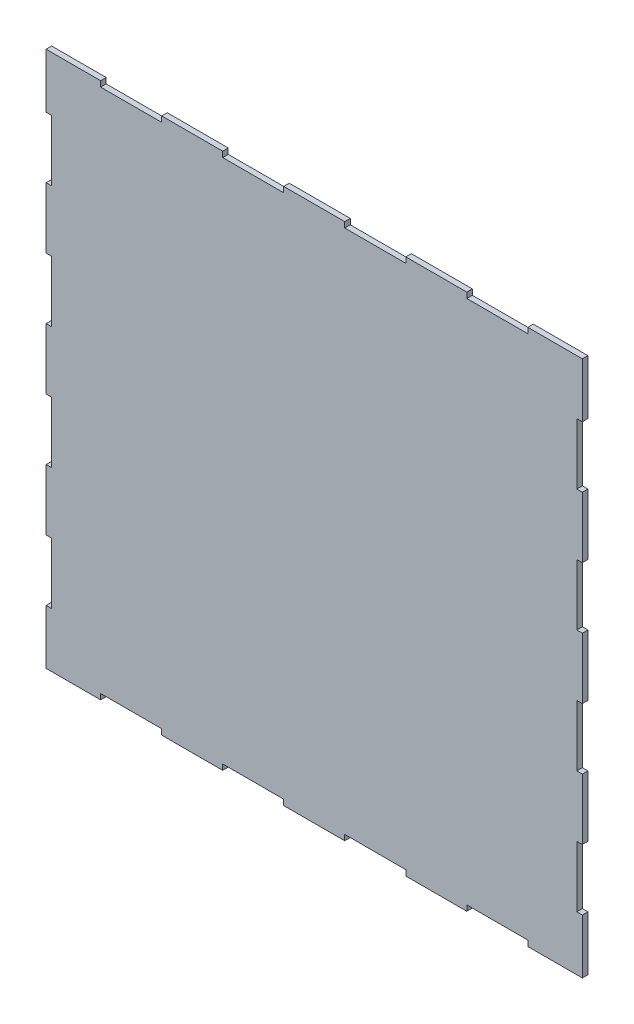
ISO-10303-21;
HEADER;
FILE_DESCRIPTION(('STEP AP214'),'2;1');
FILE_NAME('part.step','',(''),(''),'','','');
FILE_SCHEMA(('AUTOMOTIVE_DESIGN { 1 0 10303 214 1 1 1 1 }'));
ENDSEC;
DATA;
#1=APPLICATION_CONTEXT('core data for automotive mechanical design processes');
#2=APPLICATION_PROTOCOL_DEFINITION('international standard','automotive_design',2000,#1);
#3=PRODUCT_CONTEXT('',#1,'mechanical');
#4=PRODUCT('Part','Part','',(#3));
#5=PRODUCT_RELATED_PRODUCT_CATEGORY('part','',(#4));
#6=PRODUCT_DEFINITION_FORMATION('','',#4);
#7=PRODUCT_DEFINITION_CONTEXT('part definition',#1,'design');
#8=PRODUCT_DEFINITION('design','',#6,#7);
#9=PRODUCT_DEFINITION_SHAPE('','',#8);
#10=(LENGTH_UNIT() NAMED_UNIT(*) SI_UNIT(.MILLI.,.METRE.));
#11=(NAMED_UNIT(*) PLANE_ANGLE_UNIT() SI_UNIT($,.RADIAN.));
#12=(NAMED_UNIT(*) SI_UNIT($,.STERADIAN.) SOLID_ANGLE_UNIT());
#13=UNCERTAINTY_MEASURE_WITH_UNIT(LENGTH_MEASURE(1.E-05),#10,'distance_accuracy_value','');
#14=(GEOMETRIC_REPRESENTATION_CONTEXT(3) GLOBAL_UNCERTAINTY_ASSIGNED_CONTEXT((#13)) GLOBAL_UNIT_ASSIGNED_CONTEXT((#10,
#11,#12)) REPRESENTATION_CONTEXT('',''));
#15=CARTESIAN_POINT('',(0.,0.,0.));
#16=DIRECTION('',(0.,0.,1.));
#17=DIRECTION('',(1.,0.,0.));
#18=AXIS2_PLACEMENT_3D('',#15,#16,#17);
#19=CARTESIAN_POINT('',(29.5,293.,3.));
#20=DIRECTION('',(0.,-1.,0.));
#21=DIRECTION('',(0.,0.,-1.));
#22=AXIS2_PLACEMENT_3D('',#19,#20,#21);
#23=PLANE('',#22);
#24=DIRECTION('',(-1.,0.,0.));
#25=VECTOR('',#24,1.);
#26=CARTESIAN_POINT('',(29.5,293.,0.));
#27=LINE('',#26,#25);
#28=CARTESIAN_POINT('',(29.5,293.,0.));
#29=VERTEX_POINT('',#28);
#30=CARTESIAN_POINT('',(0.,293.,0.));
#31=VERTEX_POINT('',#30);
#32=EDGE_CURVE('E492',#29,#31,#27,.T.);
#33=ORIENTED_EDGE('',*,*,#32,.T.);
#34=DIRECTION('',(0.,0.,-1.));
#35=VECTOR('',#34,1.);
#36=CARTESIAN_POINT('',(0.,293.,3.));
#37=LINE('',#36,#35);
#38=CARTESIAN_POINT('',(0.,293.,3.));
#39=VERTEX_POINT('',#38);
#40=EDGE_CURVE('E11',#39,#31,#37,.T.);
#41=ORIENTED_EDGE('',*,*,#40,.F.);
#42=DIRECTION('',(-1.,0.,0.));
#43=VECTOR('',#42,1.);
#44=CARTESIAN_POINT('',(29.5,293.,3.));
#45=LINE('',#44,#43);
#46=CARTESIAN_POINT('',(29.5,293.,3.));
#47=VERTEX_POINT('',#46);
#48=EDGE_CURVE('E626',#47,#39,#45,.T.);
#49=ORIENTED_EDGE('',*,*,#48,.F.);
#50=DIRECTION('',(0.,0.,-1.));
#51=VECTOR('',#50,1.);
#52=CARTESIAN_POINT('',(29.5,293.,3.));
#53=LINE('',#52,#51);
#54=EDGE_CURVE('E488',#47,#29,#53,.T.);
#55=ORIENTED_EDGE('',*,*,#54,.T.);
#56=EDGE_LOOP('',(#33,#41,#49,#55));
#57=FACE_BOUND('',#56,.T.);
#58=ADVANCED_FACE('F36',(#57),#23,.F.);
#59=CARTESIAN_POINT('',(0.,293.,3.));
#60=DIRECTION('',(1.,0.,0.));
#61=DIRECTION('',(0.,0.,-1.));
#62=AXIS2_PLACEMENT_3D('',#59,#60,#61);
#63=PLANE('',#62);
#64=DIRECTION('',(0.,-1.,0.));
#65=VECTOR('',#64,1.);
#66=CARTESIAN_POINT('',(0.,293.,0.));
#67=LINE('',#66,#65);
#68=CARTESIAN_POINT('',(0.,263.5,0.));
#69=VERTEX_POINT('',#68);
#70=EDGE_CURVE('E495',#31,#69,#67,.T.);
#71=ORIENTED_EDGE('',*,*,#70,.T.);
#72=DIRECTION('',(0.,0.,-1.));
#73=VECTOR('',#72,1.);
#74=CARTESIAN_POINT('',(0.,263.5,3.));
#75=LINE('',#74,#73);
#76=CARTESIAN_POINT('',(0.,263.5,3.));
#77=VERTEX_POINT('',#76);
#78=EDGE_CURVE('E44',#77,#69,#75,.T.);
#79=ORIENTED_EDGE('',*,*,#78,.F.);
#80=DIRECTION('',(0.,-1.,0.));
#81=VECTOR('',#80,1.);
#82=CARTESIAN_POINT('',(0.,293.,3.));
#83=LINE('',#82,#81);
#84=EDGE_CURVE('E275',#39,#77,#83,.T.);
#85=ORIENTED_EDGE('',*,*,#84,.F.);
#86=ORIENTED_EDGE('',*,*,#40,.T.);
#87=EDGE_LOOP('',(#71,#79,#85,#86));
#88=FACE_BOUND('',#87,.T.);
#89=ADVANCED_FACE('F984',(#88),#63,.F.);
#90=CARTESIAN_POINT('',(0.,263.5,3.));
#91=DIRECTION('',(0.,1.,0.));
#92=DIRECTION('',(0.,0.,1.));
#93=AXIS2_PLACEMENT_3D('',#90,#91,#92);
#94=PLANE('',#93);
#95=DIRECTION('',(1.,0.,0.));
#96=VECTOR('',#95,1.);
#97=CARTESIAN_POINT('',(0.,263.5,0.));
#98=LINE('',#97,#96);
#99=CARTESIAN_POINT('',(3.,263.5,0.));
#100=VERTEX_POINT('',#99);
#101=EDGE_CURVE('E497',#69,#100,#98,.T.);
#102=ORIENTED_EDGE('',*,*,#101,.T.);
#103=DIRECTION('',(0.,0.,-1.));
#104=VECTOR('',#103,1.);
#105=CARTESIAN_POINT('',(3.,263.5,3.));
#106=LINE('',#105,#104);
#107=CARTESIAN_POINT('',(3.,263.5,3.));
#108=VERTEX_POINT('',#107);
#109=EDGE_CURVE('E813',#108,#100,#106,.T.);
#110=ORIENTED_EDGE('',*,*,#109,.F.);
#111=DIRECTION('',(1.,0.,0.));
#112=VECTOR('',#111,1.);
#113=CARTESIAN_POINT('',(0.,263.5,3.));
#114=LINE('',#113,#112);
#115=EDGE_CURVE('E821',#77,#108,#114,.T.);
#116=ORIENTED_EDGE('',*,*,#115,.F.);
#117=ORIENTED_EDGE('',*,*,#78,.T.);
#118=EDGE_LOOP('',(#102,#110,#116,#117));
#119=FACE_BOUND('',#118,.T.);
#120=ADVANCED_FACE('F819',(#119),#94,.F.);
#121=CARTESIAN_POINT('',(3.,263.5,3.));
#122=DIRECTION('',(1.,0.,0.));
#123=DIRECTION('',(0.,0.,-1.));
#124=AXIS2_PLACEMENT_3D('',#121,#122,#123);
#125=PLANE('',#124);
#126=DIRECTION('',(0.,-1.,0.));
#127=VECTOR('',#126,1.);
#128=CARTESIAN_POINT('',(3.,263.5,0.));
#129=LINE('',#128,#127);
#130=CARTESIAN_POINT('',(3.,230.5,0.));
#131=VERTEX_POINT('',#130);
#132=EDGE_CURVE('E499',#100,#131,#129,.T.);
#133=ORIENTED_EDGE('',*,*,#132,.T.);
#134=DIRECTION('',(0.,0.,-1.));
#135=VECTOR('',#134,1.);
#136=CARTESIAN_POINT('',(3.,230.5,3.));
#137=LINE('',#136,#135);
#138=CARTESIAN_POINT('',(3.,230.5,3.));
#139=VERTEX_POINT('',#138);
#140=EDGE_CURVE('E810',#139,#131,#137,.T.);
#141=ORIENTED_EDGE('',*,*,#140,.F.);
#142=DIRECTION('',(0.,-1.,0.));
#143=VECTOR('',#142,1.);
#144=CARTESIAN_POINT('',(3.,263.5,3.));
#145=LINE('',#144,#143);
#146=EDGE_CURVE('E839',#108,#139,#145,.T.);
#147=ORIENTED_EDGE('',*,*,#146,.F.);
#148=ORIENTED_EDGE('',*,*,#109,.T.);
#149=EDGE_LOOP('',(#133,#141,#147,#148));
#150=FACE_BOUND('',#149,.T.);
#151=ADVANCED_FACE('F830',(#150),#125,.F.);
#152=CARTESIAN_POINT('',(3.,230.5,3.));
#153=DIRECTION('',(0.,-1.,0.));
#154=DIRECTION('',(0.,0.,-1.));
#155=AXIS2_PLACEMENT_3D('',#152,#153,#154);
#156=PLANE('',#155);
#157=DIRECTION('',(-1.,0.,0.));
#158=VECTOR('',#157,1.);
#159=CARTESIAN_POINT('',(3.,230.5,0.));
#160=LINE('',#159,#158);
#161=CARTESIAN_POINT('',(0.,230.5,0.));
#162=VERTEX_POINT('',#161);
#163=EDGE_CURVE('E501',#131,#162,#160,.T.);
#164=ORIENTED_EDGE('',*,*,#163,.T.);
#165=DIRECTION('',(0.,0.,-1.));
#166=VECTOR('',#165,1.);
#167=CARTESIAN_POINT('',(0.,230.5,3.));
#168=LINE('',#167,#166);
#169=CARTESIAN_POINT('',(0.,230.5,3.));
#170=VERTEX_POINT('',#169);
#171=EDGE_CURVE('E807',#170,#162,#168,.T.);
#172=ORIENTED_EDGE('',*,*,#171,.F.);
#173=DIRECTION('',(-1.,0.,0.));
#174=VECTOR('',#173,1.);
#175=CARTESIAN_POINT('',(3.,230.5,3.));
#176=LINE('',#175,#174);
#177=EDGE_CURVE('E836',#139,#170,#176,.T.);
#178=ORIENTED_EDGE('',*,*,#177,.F.);
#179=ORIENTED_EDGE('',*,*,#140,.T.);
#180=EDGE_LOOP('',(#164,#172,#178,#179));
#181=FACE_BOUND('',#180,.T.);
#182=ADVANCED_FACE('F834',(#181),#156,.F.);
#183=CARTESIAN_POINT('',(0.,230.5,3.));
#184=DIRECTION('',(1.,0.,0.));
#185=DIRECTION('',(0.,0.,-1.));
#186=AXIS2_PLACEMENT_3D('',#183,#184,#185);
#187=PLANE('',#186);
#188=DIRECTION('',(0.,-1.,0.));
#189=VECTOR('',#188,1.);
#190=CARTESIAN_POINT('',(0.,230.5,0.));
#191=LINE('',#190,#189);
#192=CARTESIAN_POINT('',(0.,197.5,0.));
#193=VERTEX_POINT('',#192);
#194=EDGE_CURVE('E503',#162,#193,#191,.T.);
#195=ORIENTED_EDGE('',*,*,#194,.T.);
#196=DIRECTION('',(0.,0.,-1.));
#197=VECTOR('',#196,1.);
#198=CARTESIAN_POINT('',(0.,197.5,3.));
#199=LINE('',#198,#197);
#200=CARTESIAN_POINT('',(0.,197.5,3.));
#201=VERTEX_POINT('',#200);
#202=EDGE_CURVE('E804',#201,#193,#199,.T.);
#203=ORIENTED_EDGE('',*,*,#202,.F.);
#204=DIRECTION('',(0.,-1.,0.));
#205=VECTOR('',#204,1.);
#206=CARTESIAN_POINT('',(0.,230.5,3.));
#207=LINE('',#206,#205);
#208=EDGE_CURVE('E838',#170,#201,#207,.T.);
#209=ORIENTED_EDGE('',*,*,#208,.F.);
#210=ORIENTED_EDGE('',*,*,#171,.T.);
#211=EDGE_LOOP('',(#195,#203,#209,#210));
#212=FACE_BOUND('',#211,.T.);
#213=ADVANCED_FACE('F997',(#212),#187,.F.);
#214=CARTESIAN_POINT('',(0.,197.5,3.));
#215=DIRECTION('',(0.,1.,0.));
#216=DIRECTION('',(0.,0.,1.));
#217=AXIS2_PLACEMENT_3D('',#214,#215,#216);
#218=PLANE('',#217);
#219=DIRECTION('',(1.,0.,0.));
#220=VECTOR('',#219,1.);
#221=CARTESIAN_POINT('',(0.,197.5,0.));
#222=LINE('',#221,#220);
#223=CARTESIAN_POINT('',(3.,197.5,0.));
#224=VERTEX_POINT('',#223);
#225=EDGE_CURVE('E505',#193,#224,#222,.T.);
#226=ORIENTED_EDGE('',*,*,#225,.T.);
#227=DIRECTION('',(0.,0.,-1.));
#228=VECTOR('',#227,1.);
#229=CARTESIAN_POINT('',(3.,197.5,3.));
#230=LINE('',#229,#228);
#231=CARTESIAN_POINT('',(3.,197.5,3.));
#232=VERTEX_POINT('',#231);
#233=EDGE_CURVE('E801',#232,#224,#230,.T.);
#234=ORIENTED_EDGE('',*,*,#233,.F.);
#235=DIRECTION('',(1.,0.,0.));
#236=VECTOR('',#235,1.);
#237=CARTESIAN_POINT('',(0.,197.5,3.));
#238=LINE('',#237,#236);
#239=EDGE_CURVE('E841',#201,#232,#238,.T.);
#240=ORIENTED_EDGE('',*,*,#239,.F.);
#241=ORIENTED_EDGE('',*,*,#202,.T.);
#242=EDGE_LOOP('',(#226,#234,#240,#241));
#243=FACE_BOUND('',#242,.T.);
#244=ADVANCED_FACE('F1000',(#243),#218,.F.);
#245=CARTESIAN_POINT('',(3.,197.5,3.));
#246=DIRECTION('',(1.,0.,0.));
#247=DIRECTION('',(0.,0.,-1.));
#248=AXIS2_PLACEMENT_3D('',#245,#246,#247);
#249=PLANE('',#248);
#250=DIRECTION('',(0.,-1.,0.));
#251=VECTOR('',#250,1.);
#252=CARTESIAN_POINT('',(3.,197.5,0.));
#253=LINE('',#252,#251);
#254=CARTESIAN_POINT('',(3.,164.5,0.));
#255=VERTEX_POINT('',#254);
#256=EDGE_CURVE('E507',#224,#255,#253,.T.);
#257=ORIENTED_EDGE('',*,*,#256,.T.);
#258=DIRECTION('',(0.,0.,-1.));
#259=VECTOR('',#258,1.);
#260=CARTESIAN_POINT('',(3.,164.5,3.));
#261=LINE('',#260,#259);
#262=CARTESIAN_POINT('',(3.,164.5,3.));
#263=VERTEX_POINT('',#262);
#264=EDGE_CURVE('E798',#263,#255,#261,.T.);
#265=ORIENTED_EDGE('',*,*,#264,.F.);
#266=DIRECTION('',(0.,-1.,0.));
#267=VECTOR('',#266,1.);
#268=CARTESIAN_POINT('',(3.,197.5,3.));
#269=LINE('',#268,#267);
#270=EDGE_CURVE('E847',#232,#263,#269,.T.);
#271=ORIENTED_EDGE('',*,*,#270,.F.);
#272=ORIENTED_EDGE('',*,*,#233,.T.);
#273=EDGE_LOOP('',(#257,#265,#271,#272));
#274=FACE_BOUND('',#273,.T.);
#275=ADVANCED_FACE('F1004',(#274),#249,.F.);
#276=CARTESIAN_POINT('',(3.,164.5,3.));
#277=DIRECTION('',(0.,-1.,0.));
#278=DIRECTION('',(0.,0.,-1.));
#279=AXIS2_PLACEMENT_3D('',#276,#277,#278);
#280=PLANE('',#279);
#281=DIRECTION('',(-1.,0.,0.));
#282=VECTOR('',#281,1.);
#283=CARTESIAN_POINT('',(3.,164.5,0.));
#284=LINE('',#283,#282);
#285=CARTESIAN_POINT('',(0.,164.5,0.));
#286=VERTEX_POINT('',#285);
#287=EDGE_CURVE('E509',#255,#286,#284,.T.);
#288=ORIENTED_EDGE('',*,*,#287,.T.);
#289=DIRECTION('',(0.,0.,-1.));
#290=VECTOR('',#289,1.);
#291=CARTESIAN_POINT('',(0.,164.5,3.));
#292=LINE('',#291,#290);
#293=CARTESIAN_POINT('',(0.,164.5,3.));
#294=VERTEX_POINT('',#293);
#295=EDGE_CURVE('E795',#294,#286,#292,.T.);
#296=ORIENTED_EDGE('',*,*,#295,.F.);
#297=DIRECTION('',(-1.,0.,0.));
#298=VECTOR('',#297,1.);
#299=CARTESIAN_POINT('',(3.,164.5,3.));
#300=LINE('',#299,#298);
#301=EDGE_CURVE('E849',#263,#294,#300,.T.);
#302=ORIENTED_EDGE('',*,*,#301,.F.);
#303=ORIENTED_EDGE('',*,*,#264,.T.);
#304=EDGE_LOOP('',(#288,#296,#302,#303));
#305=FACE_BOUND('',#304,.T.);
#306=ADVANCED_FACE('F1008',(#305),#280,.F.);
#307=CARTESIAN_POINT('',(0.,164.5,3.));
#308=DIRECTION('',(1.,0.,0.));
#309=DIRECTION('',(0.,0.,-1.));
#310=AXIS2_PLACEMENT_3D('',#307,#308,#309);
#311=PLANE('',#310);
#312=DIRECTION('',(0.,-1.,0.));
#313=VECTOR('',#312,1.);
#314=CARTESIAN_POINT('',(0.,164.5,0.));
#315=LINE('',#314,#313);
#316=CARTESIAN_POINT('',(0.,131.5,0.));
#317=VERTEX_POINT('',#316);
#318=EDGE_CURVE('E511',#286,#317,#315,.T.);
#319=ORIENTED_EDGE('',*,*,#318,.T.);
#320=DIRECTION('',(0.,0.,-1.));
#321=VECTOR('',#320,1.);
#322=CARTESIAN_POINT('',(0.,131.5,3.));
#323=LINE('',#322,#321);
#324=CARTESIAN_POINT('',(0.,131.5,3.));
#325=VERTEX_POINT('',#324);
#326=EDGE_CURVE('E792',#325,#317,#323,.T.);
#327=ORIENTED_EDGE('',*,*,#326,.F.);
#328=DIRECTION('',(0.,-1.,0.));
#329=VECTOR('',#328,1.);
#330=CARTESIAN_POINT('',(0.,164.5,3.));
#331=LINE('',#330,#329);
#332=EDGE_CURVE('E851',#294,#325,#331,.T.);
#333=ORIENTED_EDGE('',*,*,#332,.F.);
#334=ORIENTED_EDGE('',*,*,#295,.T.);
#335=EDGE_LOOP('',(#319,#327,#333,#334));
#336=FACE_BOUND('',#335,.T.);
#337=ADVANCED_FACE('F1012',(#336),#311,.F.);
#338=CARTESIAN_POINT('',(0.,131.5,3.));
#339=DIRECTION('',(0.,1.,0.));
#340=DIRECTION('',(0.,0.,1.));
#341=AXIS2_PLACEMENT_3D('',#338,#339,#340);
#342=PLANE('',#341);
#343=DIRECTION('',(1.,0.,0.));
#344=VECTOR('',#343,1.);
#345=CARTESIAN_POINT('',(0.,131.5,0.));
#346=LINE('',#345,#344);
#347=CARTESIAN_POINT('',(3.,131.5,0.));
#348=VERTEX_POINT('',#347);
#349=EDGE_CURVE('E513',#317,#348,#346,.T.);
#350=ORIENTED_EDGE('',*,*,#349,.T.);
#351=DIRECTION('',(0.,0.,-1.));
#352=VECTOR('',#351,1.);
#353=CARTESIAN_POINT('',(3.,131.5,3.));
#354=LINE('',#353,#352);
#355=CARTESIAN_POINT('',(3.,131.5,3.));
#356=VERTEX_POINT('',#355);
#357=EDGE_CURVE('E789',#356,#348,#354,.T.);
#358=ORIENTED_EDGE('',*,*,#357,.F.);
#359=DIRECTION('',(1.,0.,0.));
#360=VECTOR('',#359,1.);
#361=CARTESIAN_POINT('',(0.,131.5,3.));
#362=LINE('',#361,#360);
#363=EDGE_CURVE('E853',#325,#356,#362,.T.);
#364=ORIENTED_EDGE('',*,*,#363,.F.);
#365=ORIENTED_EDGE('',*,*,#326,.T.);
#366=EDGE_LOOP('',(#350,#358,#364,#365));
#367=FACE_BOUND('',#366,.T.);
#368=ADVANCED_FACE('F1016',(#367),#342,.F.);
#369=CARTESIAN_POINT('',(3.,131.5,3.));
#370=DIRECTION('',(1.,0.,0.));
#371=DIRECTION('',(0.,0.,-1.));
#372=AXIS2_PLACEMENT_3D('',#369,#370,#371);
#373=PLANE('',#372);
#374=DIRECTION('',(0.,-1.,0.));
#375=VECTOR('',#374,1.);
#376=CARTESIAN_POINT('',(3.,131.5,0.));
#377=LINE('',#376,#375);
#378=CARTESIAN_POINT('',(3.,98.5,0.));
#379=VERTEX_POINT('',#378);
#380=EDGE_CURVE('E515',#348,#379,#377,.T.);
#381=ORIENTED_EDGE('',*,*,#380,.T.);
#382=DIRECTION('',(0.,0.,-1.));
#383=VECTOR('',#382,1.);
#384=CARTESIAN_POINT('',(3.,98.5,3.));
#385=LINE('',#384,#383);
#386=CARTESIAN_POINT('',(3.,98.5,3.));
#387=VERTEX_POINT('',#386);
#388=EDGE_CURVE('E786',#387,#379,#385,.T.);
#389=ORIENTED_EDGE('',*,*,#388,.F.);
#390=DIRECTION('',(0.,-1.,0.));
#391=VECTOR('',#390,1.);
#392=CARTESIAN_POINT('',(3.,131.5,3.));
#393=LINE('',#392,#391);
#394=EDGE_CURVE('E855',#356,#387,#393,.T.);
#395=ORIENTED_EDGE('',*,*,#394,.F.);
#396=ORIENTED_EDGE('',*,*,#357,.T.);
#397=EDGE_LOOP('',(#381,#389,#395,#396));
#398=FACE_BOUND('',#397,.T.);
#399=ADVANCED_FACE('F1020',(#398),#373,.F.);
#400=CARTESIAN_POINT('',(3.,98.5,3.));
#401=DIRECTION('',(0.,-1.,0.));
#402=DIRECTION('',(0.,0.,-1.));
#403=AXIS2_PLACEMENT_3D('',#400,#401,#402);
#404=PLANE('',#403);
#405=DIRECTION('',(-1.,0.,0.));
#406=VECTOR('',#405,1.);
#407=CARTESIAN_POINT('',(3.,98.5,0.));
#408=LINE('',#407,#406);
#409=CARTESIAN_POINT('',(0.,98.5,0.));
#410=VERTEX_POINT('',#409);
#411=EDGE_CURVE('E517',#379,#410,#408,.T.);
#412=ORIENTED_EDGE('',*,*,#411,.T.);
#413=DIRECTION('',(0.,0.,-1.));
#414=VECTOR('',#413,1.);
#415=CARTESIAN_POINT('',(0.,98.5,3.));
#416=LINE('',#415,#414);
#417=CARTESIAN_POINT('',(0.,98.5,3.));
#418=VERTEX_POINT('',#417);
#419=EDGE_CURVE('E783',#418,#410,#416,.T.);
#420=ORIENTED_EDGE('',*,*,#419,.F.);
#421=DIRECTION('',(-1.,0.,0.));
#422=VECTOR('',#421,1.);
#423=CARTESIAN_POINT('',(3.,98.5,3.));
#424=LINE('',#423,#422);
#425=EDGE_CURVE('E857',#387,#418,#424,.T.);
#426=ORIENTED_EDGE('',*,*,#425,.F.);
#427=ORIENTED_EDGE('',*,*,#388,.T.);
#428=EDGE_LOOP('',(#412,#420,#426,#427));
#429=FACE_BOUND('',#428,.T.);
#430=ADVANCED_FACE('F1024',(#429),#404,.F.);
#431=CARTESIAN_POINT('',(0.,98.5,3.));
#432=DIRECTION('',(1.,0.,0.));
#433=DIRECTION('',(0.,0.,-1.));
#434=AXIS2_PLACEMENT_3D('',#431,#432,#433);
#435=PLANE('',#434);
#436=DIRECTION('',(0.,-1.,0.));
#437=VECTOR('',#436,1.);
#438=CARTESIAN_POINT('',(0.,98.5,0.));
#439=LINE('',#438,#437);
#440=CARTESIAN_POINT('',(0.,65.5,0.));
#441=VERTEX_POINT('',#440);
#442=EDGE_CURVE('E519',#410,#441,#439,.T.);
#443=ORIENTED_EDGE('',*,*,#442,.T.);
#444=DIRECTION('',(0.,0.,-1.));
#445=VECTOR('',#444,1.);
#446=CARTESIAN_POINT('',(0.,65.5,3.));
#447=LINE('',#446,#445);
#448=CARTESIAN_POINT('',(0.,65.5,3.));
#449=VERTEX_POINT('',#448);
#450=EDGE_CURVE('E780',#449,#441,#447,.T.);
#451=ORIENTED_EDGE('',*,*,#450,.F.);
#452=DIRECTION('',(0.,-1.,0.));
#453=VECTOR('',#452,1.);
#454=CARTESIAN_POINT('',(0.,98.5,3.));
#455=LINE('',#454,#453);
#456=EDGE_CURVE('E859',#418,#449,#455,.T.);
#457=ORIENTED_EDGE('',*,*,#456,.F.);
#458=ORIENTED_EDGE('',*,*,#419,.T.);
#459=EDGE_LOOP('',(#443,#451,#457,#458));
#460=FACE_BOUND('',#459,.T.);
#461=ADVANCED_FACE('F1028',(#460),#435,.F.);
#462=CARTESIAN_POINT('',(0.,65.5,3.));
#463=DIRECTION('',(0.,1.,0.));
#464=DIRECTION('',(0.,0.,1.));
#465=AXIS2_PLACEMENT_3D('',#462,#463,#464);
#466=PLANE('',#465);
#467=DIRECTION('',(1.,0.,0.));
#468=VECTOR('',#467,1.);
#469=CARTESIAN_POINT('',(0.,65.5,0.));
#470=LINE('',#469,#468);
#471=CARTESIAN_POINT('',(3.,65.5,0.));
#472=VERTEX_POINT('',#471);
#473=EDGE_CURVE('E521',#441,#472,#470,.T.);
#474=ORIENTED_EDGE('',*,*,#473,.T.);
#475=DIRECTION('',(0.,0.,-1.));
#476=VECTOR('',#475,1.);
#477=CARTESIAN_POINT('',(3.,65.5,3.));
#478=LINE('',#477,#476);
#479=CARTESIAN_POINT('',(3.,65.5,3.));
#480=VERTEX_POINT('',#479);
#481=EDGE_CURVE('E777',#480,#472,#478,.T.);
#482=ORIENTED_EDGE('',*,*,#481,.F.);
#483=DIRECTION('',(1.,0.,0.));
#484=VECTOR('',#483,1.);
#485=CARTESIAN_POINT('',(0.,65.5,3.));
#486=LINE('',#485,#484);
#487=EDGE_CURVE('E861',#449,#480,#486,.T.);
#488=ORIENTED_EDGE('',*,*,#487,.F.);
#489=ORIENTED_EDGE('',*,*,#450,.T.);
#490=EDGE_LOOP('',(#474,#482,#488,#489));
#491=FACE_BOUND('',#490,.T.);
#492=ADVANCED_FACE('F1032',(#491),#466,.F.);
#493=CARTESIAN_POINT('',(3.,65.5,3.));
#494=DIRECTION('',(1.,0.,0.));
#495=DIRECTION('',(0.,0.,-1.));
#496=AXIS2_PLACEMENT_3D('',#493,#494,#495);
#497=PLANE('',#496);
#498=DIRECTION('',(0.,-1.,0.));
#499=VECTOR('',#498,1.);
#500=CARTESIAN_POINT('',(3.,65.5,0.));
#501=LINE('',#500,#499);
#502=CARTESIAN_POINT('',(3.,32.5,0.));
#503=VERTEX_POINT('',#502);
#504=EDGE_CURVE('E523',#472,#503,#501,.T.);
#505=ORIENTED_EDGE('',*,*,#504,.T.);
#506=DIRECTION('',(0.,0.,-1.));
#507=VECTOR('',#506,1.);
#508=CARTESIAN_POINT('',(3.,32.5,3.));
#509=LINE('',#508,#507);
#510=CARTESIAN_POINT('',(3.,32.5,3.));
#511=VERTEX_POINT('',#510);
#512=EDGE_CURVE('E774',#511,#503,#509,.T.);
#513=ORIENTED_EDGE('',*,*,#512,.F.);
#514=DIRECTION('',(0.,-1.,0.));
#515=VECTOR('',#514,1.);
#516=CARTESIAN_POINT('',(3.,65.5,3.));
#517=LINE('',#516,#515);
#518=EDGE_CURVE('E863',#480,#511,#517,.T.);
#519=ORIENTED_EDGE('',*,*,#518,.F.);
#520=ORIENTED_EDGE('',*,*,#481,.T.);
#521=EDGE_LOOP('',(#505,#513,#519,#520));
#522=FACE_BOUND('',#521,.T.);
#523=ADVANCED_FACE('F1036',(#522),#497,.F.);
#524=CARTESIAN_POINT('',(3.,32.5,3.));
#525=DIRECTION('',(0.,-1.,0.));
#526=DIRECTION('',(0.,0.,-1.));
#527=AXIS2_PLACEMENT_3D('',#524,#525,#526);
#528=PLANE('',#527);
#529=DIRECTION('',(-1.,0.,0.));
#530=VECTOR('',#529,1.);
#531=CARTESIAN_POINT('',(3.,32.5,0.));
#532=LINE('',#531,#530);
#533=CARTESIAN_POINT('',(0.,32.5,0.));
#534=VERTEX_POINT('',#533);
#535=EDGE_CURVE('E525',#503,#534,#532,.T.);
#536=ORIENTED_EDGE('',*,*,#535,.T.);
#537=DIRECTION('',(0.,0.,-1.));
#538=VECTOR('',#537,1.);
#539=CARTESIAN_POINT('',(0.,32.5,3.));
#540=LINE('',#539,#538);
#541=CARTESIAN_POINT('',(0.,32.5,3.));
#542=VERTEX_POINT('',#541);
#543=EDGE_CURVE('E771',#542,#534,#540,.T.);
#544=ORIENTED_EDGE('',*,*,#543,.F.);
#545=DIRECTION('',(-1.,0.,0.));
#546=VECTOR('',#545,1.);
#547=CARTESIAN_POINT('',(3.,32.5,3.));
#548=LINE('',#547,#546);
#549=EDGE_CURVE('E865',#511,#542,#548,.T.);
#550=ORIENTED_EDGE('',*,*,#549,.F.);
#551=ORIENTED_EDGE('',*,*,#512,.T.);
#552=EDGE_LOOP('',(#536,#544,#550,#551));
#553=FACE_BOUND('',#552,.T.);
#554=ADVANCED_FACE('F1040',(#553),#528,.F.);
#555=CARTESIAN_POINT('',(0.,32.5,3.));
#556=DIRECTION('',(1.,0.,0.));
#557=DIRECTION('',(0.,0.,-1.));
#558=AXIS2_PLACEMENT_3D('',#555,#556,#557);
#559=PLANE('',#558);
#560=DIRECTION('',(0.,-1.,0.));
#561=VECTOR('',#560,1.);
#562=CARTESIAN_POINT('',(0.,32.5,0.));
#563=LINE('',#562,#561);
#564=CARTESIAN_POINT('',(0.,3.,0.));
#565=VERTEX_POINT('',#564);
#566=EDGE_CURVE('E527',#534,#565,#563,.T.);
#567=ORIENTED_EDGE('',*,*,#566,.T.);
#568=DIRECTION('',(0.,0.,-1.));
#569=VECTOR('',#568,1.);
#570=CARTESIAN_POINT('',(0.,3.,3.));
#571=LINE('',#570,#569);
#572=CARTESIAN_POINT('',(0.,3.,3.));
#573=VERTEX_POINT('',#572);
#574=EDGE_CURVE('E768',#573,#565,#571,.T.);
#575=ORIENTED_EDGE('',*,*,#574,.F.);
#576=DIRECTION('',(0.,-1.,0.));
#577=VECTOR('',#576,1.);
#578=CARTESIAN_POINT('',(0.,32.5,3.));
#579=LINE('',#578,#577);
#580=EDGE_CURVE('E867',#542,#573,#579,.T.);
#581=ORIENTED_EDGE('',*,*,#580,.F.);
#582=ORIENTED_EDGE('',*,*,#543,.T.);
#583=EDGE_LOOP('',(#567,#575,#581,#582));
#584=FACE_BOUND('',#583,.T.);
#585=ADVANCED_FACE('F1044',(#584),#559,.F.);
#586=CARTESIAN_POINT('',(0.,3.,3.));
#587=DIRECTION('',(0.,1.,0.));
#588=DIRECTION('',(0.,0.,1.));
#589=AXIS2_PLACEMENT_3D('',#586,#587,#588);
#590=PLANE('',#589);
#591=DIRECTION('',(1.,0.,0.));
#592=VECTOR('',#591,1.);
#593=CARTESIAN_POINT('',(0.,3.,0.));
#594=LINE('',#593,#592);
#595=CARTESIAN_POINT('',(29.5,3.,0.));
#596=VERTEX_POINT('',#595);
#597=EDGE_CURVE('E529',#565,#596,#594,.T.);
#598=ORIENTED_EDGE('',*,*,#597,.T.);
#599=DIRECTION('',(0.,0.,-1.));
#600=VECTOR('',#599,1.);
#601=CARTESIAN_POINT('',(29.5,3.,3.));
#602=LINE('',#601,#600);
#603=CARTESIAN_POINT('',(29.5,3.,3.));
#604=VERTEX_POINT('',#603);
#605=EDGE_CURVE('E765',#604,#596,#602,.T.);
#606=ORIENTED_EDGE('',*,*,#605,.F.);
#607=DIRECTION('',(1.,0.,0.));
#608=VECTOR('',#607,1.);
#609=CARTESIAN_POINT('',(0.,3.,3.));
#610=LINE('',#609,#608);
#611=EDGE_CURVE('E869',#573,#604,#610,.T.);
#612=ORIENTED_EDGE('',*,*,#611,.F.);
#613=ORIENTED_EDGE('',*,*,#574,.T.);
#614=EDGE_LOOP('',(#598,#606,#612,#613));
#615=FACE_BOUND('',#614,.T.);
#616=ADVANCED_FACE('F1048',(#615),#590,.F.);
#617=CARTESIAN_POINT('',(29.5,3.,3.));
#618=DIRECTION('',(-1.,0.,0.));
#619=DIRECTION('',(0.,0.,1.));
#620=AXIS2_PLACEMENT_3D('',#617,#618,#619);
#621=PLANE('',#620);
#622=DIRECTION('',(0.,1.,0.));
#623=VECTOR('',#622,1.);
#624=CARTESIAN_POINT('',(29.5,3.,0.));
#625=LINE('',#624,#623);
#626=CARTESIAN_POINT('',(29.5,6.,0.));
#627=VERTEX_POINT('',#626);
#628=EDGE_CURVE('E531',#596,#627,#625,.T.);
#629=ORIENTED_EDGE('',*,*,#628,.T.);
#630=DIRECTION('',(0.,0.,-1.));
#631=VECTOR('',#630,1.);
#632=CARTESIAN_POINT('',(29.5,6.,3.));
#633=LINE('',#632,#631);
#634=CARTESIAN_POINT('',(29.5,6.,3.));
#635=VERTEX_POINT('',#634);
#636=EDGE_CURVE('E762',#635,#627,#633,.T.);
#637=ORIENTED_EDGE('',*,*,#636,.F.);
#638=DIRECTION('',(0.,1.,0.));
#639=VECTOR('',#638,1.);
#640=CARTESIAN_POINT('',(29.5,3.,3.));
#641=LINE('',#640,#639);
#642=EDGE_CURVE('E871',#604,#635,#641,.T.);
#643=ORIENTED_EDGE('',*,*,#642,.F.);
#644=ORIENTED_EDGE('',*,*,#605,.T.);
#645=EDGE_LOOP('',(#629,#637,#643,#644));
#646=FACE_BOUND('',#645,.T.);
#647=ADVANCED_FACE('F1052',(#646),#621,.F.);
#648=CARTESIAN_POINT('',(29.5,6.,3.));
#649=DIRECTION('',(0.,1.,0.));
#650=DIRECTION('',(0.,0.,1.));
#651=AXIS2_PLACEMENT_3D('',#648,#649,#650);
#652=PLANE('',#651);
#653=DIRECTION('',(1.,0.,0.));
#654=VECTOR('',#653,1.);
#655=CARTESIAN_POINT('',(29.5,6.,0.));
#656=LINE('',#655,#654);
#657=CARTESIAN_POINT('',(62.5,6.,0.));
#658=VERTEX_POINT('',#657);
#659=EDGE_CURVE('E533',#627,#658,#656,.T.);
#660=ORIENTED_EDGE('',*,*,#659,.T.);
#661=DIRECTION('',(0.,0.,-1.));
#662=VECTOR('',#661,1.);
#663=CARTESIAN_POINT('',(62.5,6.,3.));
#664=LINE('',#663,#662);
#665=CARTESIAN_POINT('',(62.5,6.,3.));
#666=VERTEX_POINT('',#665);
#667=EDGE_CURVE('E759',#666,#658,#664,.T.);
#668=ORIENTED_EDGE('',*,*,#667,.F.);
#669=DIRECTION('',(1.,0.,0.));
#670=VECTOR('',#669,1.);
#671=CARTESIAN_POINT('',(29.5,6.,3.));
#672=LINE('',#671,#670);
#673=EDGE_CURVE('E873',#635,#666,#672,.T.);
#674=ORIENTED_EDGE('',*,*,#673,.F.);
#675=ORIENTED_EDGE('',*,*,#636,.T.);
#676=EDGE_LOOP('',(#660,#668,#674,#675));
#677=FACE_BOUND('',#676,.T.);
#678=ADVANCED_FACE('F1056',(#677),#652,.F.);
#679=CARTESIAN_POINT('',(62.5,6.,3.));
#680=DIRECTION('',(1.,0.,0.));
#681=DIRECTION('',(0.,0.,-1.));
#682=AXIS2_PLACEMENT_3D('',#679,#680,#681);
#683=PLANE('',#682);
#684=DIRECTION('',(0.,-1.,0.));
#685=VECTOR('',#684,1.);
#686=CARTESIAN_POINT('',(62.5,6.,0.));
#687=LINE('',#686,#685);
#688=CARTESIAN_POINT('',(62.5,3.,0.));
#689=VERTEX_POINT('',#688);
#690=EDGE_CURVE('E535',#658,#689,#687,.T.);
#691=ORIENTED_EDGE('',*,*,#690,.T.);
#692=DIRECTION('',(0.,0.,-1.));
#693=VECTOR('',#692,1.);
#694=CARTESIAN_POINT('',(62.5,3.,3.));
#695=LINE('',#694,#693);
#696=CARTESIAN_POINT('',(62.5,3.,3.));
#697=VERTEX_POINT('',#696);
#698=EDGE_CURVE('E756',#697,#689,#695,.T.);
#699=ORIENTED_EDGE('',*,*,#698,.F.);
#700=DIRECTION('',(0.,-1.,0.));
#701=VECTOR('',#700,1.);
#702=CARTESIAN_POINT('',(62.5,6.,3.));
#703=LINE('',#702,#701);
#704=EDGE_CURVE('E875',#666,#697,#703,.T.);
#705=ORIENTED_EDGE('',*,*,#704,.F.);
#706=ORIENTED_EDGE('',*,*,#667,.T.);
#707=EDGE_LOOP('',(#691,#699,#705,#706));
#708=FACE_BOUND('',#707,.T.);
#709=ADVANCED_FACE('F1060',(#708),#683,.F.);
#710=CARTESIAN_POINT('',(62.5,3.,3.));
#711=DIRECTION('',(0.,1.,0.));
#712=DIRECTION('',(0.,0.,1.));
#713=AXIS2_PLACEMENT_3D('',#710,#711,#712);
#714=PLANE('',#713);
#715=DIRECTION('',(1.,0.,0.));
#716=VECTOR('',#715,1.);
#717=CARTESIAN_POINT('',(62.5,3.,0.));
#718=LINE('',#717,#716);
#719=CARTESIAN_POINT('',(95.5,3.,0.));
#720=VERTEX_POINT('',#719);
#721=EDGE_CURVE('E537',#689,#720,#718,.T.);
#722=ORIENTED_EDGE('',*,*,#721,.T.);
#723=DIRECTION('',(0.,0.,-1.));
#724=VECTOR('',#723,1.);
#725=CARTESIAN_POINT('',(95.5,3.,3.));
#726=LINE('',#725,#724);
#727=CARTESIAN_POINT('',(95.5,3.,3.));
#728=VERTEX_POINT('',#727);
#729=EDGE_CURVE('E753',#728,#720,#726,.T.);
#730=ORIENTED_EDGE('',*,*,#729,.F.);
#731=DIRECTION('',(1.,0.,0.));
#732=VECTOR('',#731,1.);
#733=CARTESIAN_POINT('',(62.5,3.,3.));
#734=LINE('',#733,#732);
#735=EDGE_CURVE('E877',#697,#728,#734,.T.);
#736=ORIENTED_EDGE('',*,*,#735,.F.);
#737=ORIENTED_EDGE('',*,*,#698,.T.);
#738=EDGE_LOOP('',(#722,#730,#736,#737));
#739=FACE_BOUND('',#738,.T.);
#740=ADVANCED_FACE('F1064',(#739),#714,.F.);
#741=CARTESIAN_POINT('',(95.5,3.,3.));
#742=DIRECTION('',(-1.,0.,0.));
#743=DIRECTION('',(0.,0.,1.));
#744=AXIS2_PLACEMENT_3D('',#741,#742,#743);
#745=PLANE('',#744);
#746=DIRECTION('',(0.,1.,0.));
#747=VECTOR('',#746,1.);
#748=CARTESIAN_POINT('',(95.5,3.,0.));
#749=LINE('',#748,#747);
#750=CARTESIAN_POINT('',(95.5,6.,0.));
#751=VERTEX_POINT('',#750);
#752=EDGE_CURVE('E539',#720,#751,#749,.T.);
#753=ORIENTED_EDGE('',*,*,#752,.T.);
#754=DIRECTION('',(0.,0.,-1.));
#755=VECTOR('',#754,1.);
#756=CARTESIAN_POINT('',(95.5,6.,3.));
#757=LINE('',#756,#755);
#758=CARTESIAN_POINT('',(95.5,6.,3.));
#759=VERTEX_POINT('',#758);
#760=EDGE_CURVE('E750',#759,#751,#757,.T.);
#761=ORIENTED_EDGE('',*,*,#760,.F.);
#762=DIRECTION('',(0.,1.,0.));
#763=VECTOR('',#762,1.);
#764=CARTESIAN_POINT('',(95.5,3.,3.));
#765=LINE('',#764,#763);
#766=EDGE_CURVE('E879',#728,#759,#765,.T.);
#767=ORIENTED_EDGE('',*,*,#766,.F.);
#768=ORIENTED_EDGE('',*,*,#729,.T.);
#769=EDGE_LOOP('',(#753,#761,#767,#768));
#770=FACE_BOUND('',#769,.T.);
#771=ADVANCED_FACE('F1068',(#770),#745,.F.);
#772=CARTESIAN_POINT('',(95.5,6.,3.));
#773=DIRECTION('',(0.,1.,0.));
#774=DIRECTION('',(0.,0.,1.));
#775=AXIS2_PLACEMENT_3D('',#772,#773,#774);
#776=PLANE('',#775);
#777=DIRECTION('',(1.,0.,0.));
#778=VECTOR('',#777,1.);
#779=CARTESIAN_POINT('',(95.5,6.,0.));
#780=LINE('',#779,#778);
#781=CARTESIAN_POINT('',(128.5,6.,0.));
#782=VERTEX_POINT('',#781);
#783=EDGE_CURVE('E541',#751,#782,#780,.T.);
#784=ORIENTED_EDGE('',*,*,#783,.T.);
#785=DIRECTION('',(0.,0.,-1.));
#786=VECTOR('',#785,1.);
#787=CARTESIAN_POINT('',(128.5,6.,3.));
#788=LINE('',#787,#786);
#789=CARTESIAN_POINT('',(128.5,6.,3.));
#790=VERTEX_POINT('',#789);
#791=EDGE_CURVE('E747',#790,#782,#788,.T.);
#792=ORIENTED_EDGE('',*,*,#791,.F.);
#793=DIRECTION('',(1.,0.,0.));
#794=VECTOR('',#793,1.);
#795=CARTESIAN_POINT('',(95.5,6.,3.));
#796=LINE('',#795,#794);
#797=EDGE_CURVE('E881',#759,#790,#796,.T.);
#798=ORIENTED_EDGE('',*,*,#797,.F.);
#799=ORIENTED_EDGE('',*,*,#760,.T.);
#800=EDGE_LOOP('',(#784,#792,#798,#799));
#801=FACE_BOUND('',#800,.T.);
#802=ADVANCED_FACE('F1072',(#801),#776,.F.);
#803=CARTESIAN_POINT('',(128.5,6.,3.));
#804=DIRECTION('',(1.,0.,0.));
#805=DIRECTION('',(0.,0.,-1.));
#806=AXIS2_PLACEMENT_3D('',#803,#804,#805);
#807=PLANE('',#806);
#808=DIRECTION('',(0.,-1.,0.));
#809=VECTOR('',#808,1.);
#810=CARTESIAN_POINT('',(128.5,6.,0.));
#811=LINE('',#810,#809);
#812=CARTESIAN_POINT('',(128.5,3.,0.));
#813=VERTEX_POINT('',#812);
#814=EDGE_CURVE('E543',#782,#813,#811,.T.);
#815=ORIENTED_EDGE('',*,*,#814,.T.);
#816=DIRECTION('',(0.,0.,-1.));
#817=VECTOR('',#816,1.);
#818=CARTESIAN_POINT('',(128.5,3.,3.));
#819=LINE('',#818,#817);
#820=CARTESIAN_POINT('',(128.5,3.,3.));
#821=VERTEX_POINT('',#820);
#822=EDGE_CURVE('E744',#821,#813,#819,.T.);
#823=ORIENTED_EDGE('',*,*,#822,.F.);
#824=DIRECTION('',(0.,-1.,0.));
#825=VECTOR('',#824,1.);
#826=CARTESIAN_POINT('',(128.5,6.,3.));
#827=LINE('',#826,#825);
#828=EDGE_CURVE('E883',#790,#821,#827,.T.);
#829=ORIENTED_EDGE('',*,*,#828,.F.);
#830=ORIENTED_EDGE('',*,*,#791,.T.);
#831=EDGE_LOOP('',(#815,#823,#829,#830));
#832=FACE_BOUND('',#831,.T.);
#833=ADVANCED_FACE('F1076',(#832),#807,.F.);
#834=CARTESIAN_POINT('',(128.5,3.,3.));
#835=DIRECTION('',(0.,1.,0.));
#836=DIRECTION('',(0.,0.,1.));
#837=AXIS2_PLACEMENT_3D('',#834,#835,#836);
#838=PLANE('',#837);
#839=DIRECTION('',(1.,0.,0.));
#840=VECTOR('',#839,1.);
#841=CARTESIAN_POINT('',(128.5,3.,0.));
#842=LINE('',#841,#840);
#843=CARTESIAN_POINT('',(161.5,3.,0.));
#844=VERTEX_POINT('',#843);
#845=EDGE_CURVE('E545',#813,#844,#842,.T.);
#846=ORIENTED_EDGE('',*,*,#845,.T.);
#847=DIRECTION('',(0.,0.,-1.));
#848=VECTOR('',#847,1.);
#849=CARTESIAN_POINT('',(161.5,3.,3.));
#850=LINE('',#849,#848);
#851=CARTESIAN_POINT('',(161.5,3.,3.));
#852=VERTEX_POINT('',#851);
#853=EDGE_CURVE('E741',#852,#844,#850,.T.);
#854=ORIENTED_EDGE('',*,*,#853,.F.);
#855=DIRECTION('',(1.,0.,0.));
#856=VECTOR('',#855,1.);
#857=CARTESIAN_POINT('',(128.5,3.,3.));
#858=LINE('',#857,#856);
#859=EDGE_CURVE('E885',#821,#852,#858,.T.);
#860=ORIENTED_EDGE('',*,*,#859,.F.);
#861=ORIENTED_EDGE('',*,*,#822,.T.);
#862=EDGE_LOOP('',(#846,#854,#860,#861));
#863=FACE_BOUND('',#862,.T.);
#864=ADVANCED_FACE('F1080',(#863),#838,.F.);
#865=CARTESIAN_POINT('',(161.5,3.,3.));
#866=DIRECTION('',(-1.,0.,0.));
#867=DIRECTION('',(0.,0.,1.));
#868=AXIS2_PLACEMENT_3D('',#865,#866,#867);
#869=PLANE('',#868);
#870=DIRECTION('',(0.,1.,0.));
#871=VECTOR('',#870,1.);
#872=CARTESIAN_POINT('',(161.5,3.,0.));
#873=LINE('',#872,#871);
#874=CARTESIAN_POINT('',(161.5,6.,0.));
#875=VERTEX_POINT('',#874);
#876=EDGE_CURVE('E547',#844,#875,#873,.T.);
#877=ORIENTED_EDGE('',*,*,#876,.T.);
#878=DIRECTION('',(0.,0.,-1.));
#879=VECTOR('',#878,1.);
#880=CARTESIAN_POINT('',(161.5,6.,3.));
#881=LINE('',#880,#879);
#882=CARTESIAN_POINT('',(161.5,6.,3.));
#883=VERTEX_POINT('',#882);
#884=EDGE_CURVE('E738',#883,#875,#881,.T.);
#885=ORIENTED_EDGE('',*,*,#884,.F.);
#886=DIRECTION('',(0.,1.,0.));
#887=VECTOR('',#886,1.);
#888=CARTESIAN_POINT('',(161.5,3.,3.));
#889=LINE('',#888,#887);
#890=EDGE_CURVE('E887',#852,#883,#889,.T.);
#891=ORIENTED_EDGE('',*,*,#890,.F.);
#892=ORIENTED_EDGE('',*,*,#853,.T.);
#893=EDGE_LOOP('',(#877,#885,#891,#892));
#894=FACE_BOUND('',#893,.T.);
#895=ADVANCED_FACE('F1084',(#894),#869,.F.);
#896=CARTESIAN_POINT('',(161.5,6.,3.));
#897=DIRECTION('',(0.,1.,0.));
#898=DIRECTION('',(0.,0.,1.));
#899=AXIS2_PLACEMENT_3D('',#896,#897,#898);
#900=PLANE('',#899);
#901=DIRECTION('',(1.,0.,0.));
#902=VECTOR('',#901,1.);
#903=CARTESIAN_POINT('',(161.5,6.,0.));
#904=LINE('',#903,#902);
#905=CARTESIAN_POINT('',(194.5,6.,0.));
#906=VERTEX_POINT('',#905);
#907=EDGE_CURVE('E549',#875,#906,#904,.T.);
#908=ORIENTED_EDGE('',*,*,#907,.T.);
#909=DIRECTION('',(0.,0.,-1.));
#910=VECTOR('',#909,1.);
#911=CARTESIAN_POINT('',(194.5,6.,3.));
#912=LINE('',#911,#910);
#913=CARTESIAN_POINT('',(194.5,6.,3.));
#914=VERTEX_POINT('',#913);
#915=EDGE_CURVE('E735',#914,#906,#912,.T.);
#916=ORIENTED_EDGE('',*,*,#915,.F.);
#917=DIRECTION('',(1.,0.,0.));
#918=VECTOR('',#917,1.);
#919=CARTESIAN_POINT('',(161.5,6.,3.));
#920=LINE('',#919,#918);
#921=EDGE_CURVE('E889',#883,#914,#920,.T.);
#922=ORIENTED_EDGE('',*,*,#921,.F.);
#923=ORIENTED_EDGE('',*,*,#884,.T.);
#924=EDGE_LOOP('',(#908,#916,#922,#923));
#925=FACE_BOUND('',#924,.T.);
#926=ADVANCED_FACE('F1088',(#925),#900,.F.);
#927=CARTESIAN_POINT('',(194.5,6.,3.));
#928=DIRECTION('',(1.,0.,0.));
#929=DIRECTION('',(0.,0.,-1.));
#930=AXIS2_PLACEMENT_3D('',#927,#928,#929);
#931=PLANE('',#930);
#932=DIRECTION('',(0.,-1.,0.));
#933=VECTOR('',#932,1.);
#934=CARTESIAN_POINT('',(194.5,6.,0.));
#935=LINE('',#934,#933);
#936=CARTESIAN_POINT('',(194.5,3.,0.));
#937=VERTEX_POINT('',#936);
#938=EDGE_CURVE('E551',#906,#937,#935,.T.);
#939=ORIENTED_EDGE('',*,*,#938,.T.);
#940=DIRECTION('',(0.,0.,-1.));
#941=VECTOR('',#940,1.);
#942=CARTESIAN_POINT('',(194.5,3.,3.));
#943=LINE('',#942,#941);
#944=CARTESIAN_POINT('',(194.5,3.,3.));
#945=VERTEX_POINT('',#944);
#946=EDGE_CURVE('E732',#945,#937,#943,.T.);
#947=ORIENTED_EDGE('',*,*,#946,.F.);
#948=DIRECTION('',(0.,-1.,0.));
#949=VECTOR('',#948,1.);
#950=CARTESIAN_POINT('',(194.5,6.,3.));
#951=LINE('',#950,#949);
#952=EDGE_CURVE('E891',#914,#945,#951,.T.);
#953=ORIENTED_EDGE('',*,*,#952,.F.);
#954=ORIENTED_EDGE('',*,*,#915,.T.);
#955=EDGE_LOOP('',(#939,#947,#953,#954));
#956=FACE_BOUND('',#955,.T.);
#957=ADVANCED_FACE('F1092',(#956),#931,.F.);
#958=CARTESIAN_POINT('',(194.5,3.,3.));
#959=DIRECTION('',(0.,1.,0.));
#960=DIRECTION('',(0.,0.,1.));
#961=AXIS2_PLACEMENT_3D('',#958,#959,#960);
#962=PLANE('',#961);
#963=DIRECTION('',(1.,0.,0.));
#964=VECTOR('',#963,1.);
#965=CARTESIAN_POINT('',(194.5,3.,0.));
#966=LINE('',#965,#964);
#967=CARTESIAN_POINT('',(227.5,3.,0.));
#968=VERTEX_POINT('',#967);
#969=EDGE_CURVE('E553',#937,#968,#966,.T.);
#970=ORIENTED_EDGE('',*,*,#969,.T.);
#971=DIRECTION('',(0.,0.,-1.));
#972=VECTOR('',#971,1.);
#973=CARTESIAN_POINT('',(227.5,3.,3.));
#974=LINE('',#973,#972);
#975=CARTESIAN_POINT('',(227.5,3.,3.));
#976=VERTEX_POINT('',#975);
#977=EDGE_CURVE('E729',#976,#968,#974,.T.);
#978=ORIENTED_EDGE('',*,*,#977,.F.);
#979=DIRECTION('',(1.,0.,0.));
#980=VECTOR('',#979,1.);
#981=CARTESIAN_POINT('',(194.5,3.,3.));
#982=LINE('',#981,#980);
#983=EDGE_CURVE('E893',#945,#976,#982,.T.);
#984=ORIENTED_EDGE('',*,*,#983,.F.);
#985=ORIENTED_EDGE('',*,*,#946,.T.);
#986=EDGE_LOOP('',(#970,#978,#984,#985));
#987=FACE_BOUND('',#986,.T.);
#988=ADVANCED_FACE('F1096',(#987),#962,.F.);
#989=CARTESIAN_POINT('',(227.5,3.,3.));
#990=DIRECTION('',(-1.,0.,0.));
#991=DIRECTION('',(0.,0.,1.));
#992=AXIS2_PLACEMENT_3D('',#989,#990,#991);
#993=PLANE('',#992);
#994=DIRECTION('',(0.,1.,0.));
#995=VECTOR('',#994,1.);
#996=CARTESIAN_POINT('',(227.5,3.,0.));
#997=LINE('',#996,#995);
#998=CARTESIAN_POINT('',(227.5,6.,0.));
#999=VERTEX_POINT('',#998);
#1000=EDGE_CURVE('E555',#968,#999,#997,.T.);
#1001=ORIENTED_EDGE('',*,*,#1000,.T.);
#1002=DIRECTION('',(0.,0.,-1.));
#1003=VECTOR('',#1002,1.);
#1004=CARTESIAN_POINT('',(227.5,6.,3.));
#1005=LINE('',#1004,#1003);
#1006=CARTESIAN_POINT('',(227.5,6.,3.));
#1007=VERTEX_POINT('',#1006);
#1008=EDGE_CURVE('E726',#1007,#999,#1005,.T.);
#1009=ORIENTED_EDGE('',*,*,#1008,.F.);
#1010=DIRECTION('',(0.,1.,0.));
#1011=VECTOR('',#1010,1.);
#1012=CARTESIAN_POINT('',(227.5,3.,3.));
#1013=LINE('',#1012,#1011);
#1014=EDGE_CURVE('E895',#976,#1007,#1013,.T.);
#1015=ORIENTED_EDGE('',*,*,#1014,.F.);
#1016=ORIENTED_EDGE('',*,*,#977,.T.);
#1017=EDGE_LOOP('',(#1001,#1009,#1015,#1016));
#1018=FACE_BOUND('',#1017,.T.);
#1019=ADVANCED_FACE('F1100',(#1018),#993,.F.);
#1020=CARTESIAN_POINT('',(227.5,6.,3.));
#1021=DIRECTION('',(0.,1.,0.));
#1022=DIRECTION('',(0.,0.,1.));
#1023=AXIS2_PLACEMENT_3D('',#1020,#1021,#1022);
#1024=PLANE('',#1023);
#1025=DIRECTION('',(1.,0.,0.));
#1026=VECTOR('',#1025,1.);
#1027=CARTESIAN_POINT('',(227.5,6.,0.));
#1028=LINE('',#1027,#1026);
#1029=CARTESIAN_POINT('',(260.5,6.,0.));
#1030=VERTEX_POINT('',#1029);
#1031=EDGE_CURVE('E557',#999,#1030,#1028,.T.);
#1032=ORIENTED_EDGE('',*,*,#1031,.T.);
#1033=DIRECTION('',(0.,0.,-1.));
#1034=VECTOR('',#1033,1.);
#1035=CARTESIAN_POINT('',(260.5,6.,3.));
#1036=LINE('',#1035,#1034);
#1037=CARTESIAN_POINT('',(260.5,6.,3.));
#1038=VERTEX_POINT('',#1037);
#1039=EDGE_CURVE('E723',#1038,#1030,#1036,.T.);
#1040=ORIENTED_EDGE('',*,*,#1039,.F.);
#1041=DIRECTION('',(1.,0.,0.));
#1042=VECTOR('',#1041,1.);
#1043=CARTESIAN_POINT('',(227.5,6.,3.));
#1044=LINE('',#1043,#1042);
#1045=EDGE_CURVE('E897',#1007,#1038,#1044,.T.);
#1046=ORIENTED_EDGE('',*,*,#1045,.F.);
#1047=ORIENTED_EDGE('',*,*,#1008,.T.);
#1048=EDGE_LOOP('',(#1032,#1040,#1046,#1047));
#1049=FACE_BOUND('',#1048,.T.);
#1050=ADVANCED_FACE('F1104',(#1049),#1024,.F.);
#1051=CARTESIAN_POINT('',(260.5,6.,3.));
#1052=DIRECTION('',(1.,0.,0.));
#1053=DIRECTION('',(0.,0.,-1.));
#1054=AXIS2_PLACEMENT_3D('',#1051,#1052,#1053);
#1055=PLANE('',#1054);
#1056=DIRECTION('',(0.,-1.,0.));
#1057=VECTOR('',#1056,1.);
#1058=CARTESIAN_POINT('',(260.5,6.,0.));
#1059=LINE('',#1058,#1057);
#1060=CARTESIAN_POINT('',(260.5,3.,0.));
#1061=VERTEX_POINT('',#1060);
#1062=EDGE_CURVE('E559',#1030,#1061,#1059,.T.);
#1063=ORIENTED_EDGE('',*,*,#1062,.T.);
#1064=DIRECTION('',(0.,0.,-1.));
#1065=VECTOR('',#1064,1.);
#1066=CARTESIAN_POINT('',(260.5,3.,3.));
#1067=LINE('',#1066,#1065);
#1068=CARTESIAN_POINT('',(260.5,3.,3.));
#1069=VERTEX_POINT('',#1068);
#1070=EDGE_CURVE('E720',#1069,#1061,#1067,.T.);
#1071=ORIENTED_EDGE('',*,*,#1070,.F.);
#1072=DIRECTION('',(0.,-1.,0.));
#1073=VECTOR('',#1072,1.);
#1074=CARTESIAN_POINT('',(260.5,6.,3.));
#1075=LINE('',#1074,#1073);
#1076=EDGE_CURVE('E899',#1038,#1069,#1075,.T.);
#1077=ORIENTED_EDGE('',*,*,#1076,.F.);
#1078=ORIENTED_EDGE('',*,*,#1039,.T.);
#1079=EDGE_LOOP('',(#1063,#1071,#1077,#1078));
#1080=FACE_BOUND('',#1079,.T.);
#1081=ADVANCED_FACE('F1108',(#1080),#1055,.F.);
#1082=CARTESIAN_POINT('',(260.5,3.,3.));
#1083=DIRECTION('',(0.,1.,0.));
#1084=DIRECTION('',(0.,0.,1.));
#1085=AXIS2_PLACEMENT_3D('',#1082,#1083,#1084);
#1086=PLANE('',#1085);
#1087=DIRECTION('',(1.,0.,0.));
#1088=VECTOR('',#1087,1.);
#1089=CARTESIAN_POINT('',(260.5,3.,0.));
#1090=LINE('',#1089,#1088);
#1091=CARTESIAN_POINT('',(290.,3.,0.));
#1092=VERTEX_POINT('',#1091);
#1093=EDGE_CURVE('E561',#1061,#1092,#1090,.T.);
#1094=ORIENTED_EDGE('',*,*,#1093,.T.);
#1095=DIRECTION('',(0.,0.,-1.));
#1096=VECTOR('',#1095,1.);
#1097=CARTESIAN_POINT('',(290.,3.,3.));
#1098=LINE('',#1097,#1096);
#1099=CARTESIAN_POINT('',(290.,3.,3.));
#1100=VERTEX_POINT('',#1099);
#1101=EDGE_CURVE('E717',#1100,#1092,#1098,.T.);
#1102=ORIENTED_EDGE('',*,*,#1101,.F.);
#1103=DIRECTION('',(1.,0.,0.));
#1104=VECTOR('',#1103,1.);
#1105=CARTESIAN_POINT('',(260.5,3.,3.));
#1106=LINE('',#1105,#1104);
#1107=EDGE_CURVE('E901',#1069,#1100,#1106,.T.);
#1108=ORIENTED_EDGE('',*,*,#1107,.F.);
#1109=ORIENTED_EDGE('',*,*,#1070,.T.);
#1110=EDGE_LOOP('',(#1094,#1102,#1108,#1109));
#1111=FACE_BOUND('',#1110,.T.);
#1112=ADVANCED_FACE('F1112',(#1111),#1086,.F.);
#1113=CARTESIAN_POINT('',(290.,3.,3.));
#1114=DIRECTION('',(-1.,0.,0.));
#1115=DIRECTION('',(0.,0.,1.));
#1116=AXIS2_PLACEMENT_3D('',#1113,#1114,#1115);
#1117=PLANE('',#1116);
#1118=DIRECTION('',(0.,1.,0.));
#1119=VECTOR('',#1118,1.);
#1120=CARTESIAN_POINT('',(290.,3.,0.));
#1121=LINE('',#1120,#1119);
#1122=CARTESIAN_POINT('',(290.,32.5,0.));
#1123=VERTEX_POINT('',#1122);
#1124=EDGE_CURVE('E563',#1092,#1123,#1121,.T.);
#1125=ORIENTED_EDGE('',*,*,#1124,.T.);
#1126=DIRECTION('',(0.,0.,-1.));
#1127=VECTOR('',#1126,1.);
#1128=CARTESIAN_POINT('',(290.,32.5,3.));
#1129=LINE('',#1128,#1127);
#1130=CARTESIAN_POINT('',(290.,32.5,3.));
#1131=VERTEX_POINT('',#1130);
#1132=EDGE_CURVE('E714',#1131,#1123,#1129,.T.);
#1133=ORIENTED_EDGE('',*,*,#1132,.F.);
#1134=DIRECTION('',(0.,1.,0.));
#1135=VECTOR('',#1134,1.);
#1136=CARTESIAN_POINT('',(290.,3.,3.));
#1137=LINE('',#1136,#1135);
#1138=EDGE_CURVE('E903',#1100,#1131,#1137,.T.);
#1139=ORIENTED_EDGE('',*,*,#1138,.F.);
#1140=ORIENTED_EDGE('',*,*,#1101,.T.);
#1141=EDGE_LOOP('',(#1125,#1133,#1139,#1140));
#1142=FACE_BOUND('',#1141,.T.);
#1143=ADVANCED_FACE('F1116',(#1142),#1117,.F.);
#1144=CARTESIAN_POINT('',(290.,32.5,3.));
#1145=DIRECTION('',(0.,-1.,0.));
#1146=DIRECTION('',(0.,0.,-1.));
#1147=AXIS2_PLACEMENT_3D('',#1144,#1145,#1146);
#1148=PLANE('',#1147);
#1149=DIRECTION('',(-1.,0.,0.));
#1150=VECTOR('',#1149,1.);
#1151=CARTESIAN_POINT('',(290.,32.5,0.));
#1152=LINE('',#1151,#1150);
#1153=CARTESIAN_POINT('',(287.,32.5,0.));
#1154=VERTEX_POINT('',#1153);
#1155=EDGE_CURVE('E565',#1123,#1154,#1152,.T.);
#1156=ORIENTED_EDGE('',*,*,#1155,.T.);
#1157=DIRECTION('',(0.,0.,-1.));
#1158=VECTOR('',#1157,1.);
#1159=CARTESIAN_POINT('',(287.,32.5,3.));
#1160=LINE('',#1159,#1158);
#1161=CARTESIAN_POINT('',(287.,32.5,3.));
#1162=VERTEX_POINT('',#1161);
#1163=EDGE_CURVE('E711',#1162,#1154,#1160,.T.);
#1164=ORIENTED_EDGE('',*,*,#1163,.F.);
#1165=DIRECTION('',(-1.,0.,0.));
#1166=VECTOR('',#1165,1.);
#1167=CARTESIAN_POINT('',(290.,32.5,3.));
#1168=LINE('',#1167,#1166);
#1169=EDGE_CURVE('E905',#1131,#1162,#1168,.T.);
#1170=ORIENTED_EDGE('',*,*,#1169,.F.);
#1171=ORIENTED_EDGE('',*,*,#1132,.T.);
#1172=EDGE_LOOP('',(#1156,#1164,#1170,#1171));
#1173=FACE_BOUND('',#1172,.T.);
#1174=ADVANCED_FACE('F1120',(#1173),#1148,.F.);
#1175=CARTESIAN_POINT('',(287.,32.5,3.));
#1176=DIRECTION('',(-1.,0.,0.));
#1177=DIRECTION('',(0.,0.,1.));
#1178=AXIS2_PLACEMENT_3D('',#1175,#1176,#1177);
#1179=PLANE('',#1178);
#1180=DIRECTION('',(0.,1.,0.));
#1181=VECTOR('',#1180,1.);
#1182=CARTESIAN_POINT('',(287.,32.5,0.));
#1183=LINE('',#1182,#1181);
#1184=CARTESIAN_POINT('',(287.,65.5,0.));
#1185=VERTEX_POINT('',#1184);
#1186=EDGE_CURVE('E567',#1154,#1185,#1183,.T.);
#1187=ORIENTED_EDGE('',*,*,#1186,.T.);
#1188=DIRECTION('',(0.,0.,-1.));
#1189=VECTOR('',#1188,1.);
#1190=CARTESIAN_POINT('',(287.,65.5,3.));
#1191=LINE('',#1190,#1189);
#1192=CARTESIAN_POINT('',(287.,65.5,3.));
#1193=VERTEX_POINT('',#1192);
#1194=EDGE_CURVE('E708',#1193,#1185,#1191,.T.);
#1195=ORIENTED_EDGE('',*,*,#1194,.F.);
#1196=DIRECTION('',(0.,1.,0.));
#1197=VECTOR('',#1196,1.);
#1198=CARTESIAN_POINT('',(287.,32.5,3.));
#1199=LINE('',#1198,#1197);
#1200=EDGE_CURVE('E907',#1162,#1193,#1199,.T.);
#1201=ORIENTED_EDGE('',*,*,#1200,.F.);
#1202=ORIENTED_EDGE('',*,*,#1163,.T.);
#1203=EDGE_LOOP('',(#1187,#1195,#1201,#1202));
#1204=FACE_BOUND('',#1203,.T.);
#1205=ADVANCED_FACE('F1124',(#1204),#1179,.F.);
#1206=CARTESIAN_POINT('',(287.,65.5,3.));
#1207=DIRECTION('',(0.,1.,0.));
#1208=DIRECTION('',(0.,0.,1.));
#1209=AXIS2_PLACEMENT_3D('',#1206,#1207,#1208);
#1210=PLANE('',#1209);
#1211=DIRECTION('',(1.,0.,0.));
#1212=VECTOR('',#1211,1.);
#1213=CARTESIAN_POINT('',(287.,65.5,0.));
#1214=LINE('',#1213,#1212);
#1215=CARTESIAN_POINT('',(290.,65.5,0.));
#1216=VERTEX_POINT('',#1215);
#1217=EDGE_CURVE('E569',#1185,#1216,#1214,.T.);
#1218=ORIENTED_EDGE('',*,*,#1217,.T.);
#1219=DIRECTION('',(0.,0.,-1.));
#1220=VECTOR('',#1219,1.);
#1221=CARTESIAN_POINT('',(290.,65.5,3.));
#1222=LINE('',#1221,#1220);
#1223=CARTESIAN_POINT('',(290.,65.5,3.));
#1224=VERTEX_POINT('',#1223);
#1225=EDGE_CURVE('E705',#1224,#1216,#1222,.T.);
#1226=ORIENTED_EDGE('',*,*,#1225,.F.);
#1227=DIRECTION('',(1.,0.,0.));
#1228=VECTOR('',#1227,1.);
#1229=CARTESIAN_POINT('',(287.,65.5,3.));
#1230=LINE('',#1229,#1228);
#1231=EDGE_CURVE('E909',#1193,#1224,#1230,.T.);
#1232=ORIENTED_EDGE('',*,*,#1231,.F.);
#1233=ORIENTED_EDGE('',*,*,#1194,.T.);
#1234=EDGE_LOOP('',(#1218,#1226,#1232,#1233));
#1235=FACE_BOUND('',#1234,.T.);
#1236=ADVANCED_FACE('F1128',(#1235),#1210,.F.);
#1237=CARTESIAN_POINT('',(290.,65.5,3.));
#1238=DIRECTION('',(-1.,0.,0.));
#1239=DIRECTION('',(0.,0.,1.));
#1240=AXIS2_PLACEMENT_3D('',#1237,#1238,#1239);
#1241=PLANE('',#1240);
#1242=DIRECTION('',(0.,1.,0.));
#1243=VECTOR('',#1242,1.);
#1244=CARTESIAN_POINT('',(290.,65.5,0.));
#1245=LINE('',#1244,#1243);
#1246=CARTESIAN_POINT('',(290.,98.5,0.));
#1247=VERTEX_POINT('',#1246);
#1248=EDGE_CURVE('E571',#1216,#1247,#1245,.T.);
#1249=ORIENTED_EDGE('',*,*,#1248,.T.);
#1250=DIRECTION('',(0.,0.,-1.));
#1251=VECTOR('',#1250,1.);
#1252=CARTESIAN_POINT('',(290.,98.5,3.));
#1253=LINE('',#1252,#1251);
#1254=CARTESIAN_POINT('',(290.,98.5,3.));
#1255=VERTEX_POINT('',#1254);
#1256=EDGE_CURVE('E702',#1255,#1247,#1253,.T.);
#1257=ORIENTED_EDGE('',*,*,#1256,.F.);
#1258=DIRECTION('',(0.,1.,0.));
#1259=VECTOR('',#1258,1.);
#1260=CARTESIAN_POINT('',(290.,65.5,3.));
#1261=LINE('',#1260,#1259);
#1262=EDGE_CURVE('E911',#1224,#1255,#1261,.T.);
#1263=ORIENTED_EDGE('',*,*,#1262,.F.);
#1264=ORIENTED_EDGE('',*,*,#1225,.T.);
#1265=EDGE_LOOP('',(#1249,#1257,#1263,#1264));
#1266=FACE_BOUND('',#1265,.T.);
#1267=ADVANCED_FACE('F1132',(#1266),#1241,.F.);
#1268=CARTESIAN_POINT('',(290.,98.5,3.));
#1269=DIRECTION('',(0.,-1.,0.));
#1270=DIRECTION('',(0.,0.,-1.));
#1271=AXIS2_PLACEMENT_3D('',#1268,#1269,#1270);
#1272=PLANE('',#1271);
#1273=DIRECTION('',(-1.,0.,0.));
#1274=VECTOR('',#1273,1.);
#1275=CARTESIAN_POINT('',(290.,98.5,0.));
#1276=LINE('',#1275,#1274);
#1277=CARTESIAN_POINT('',(287.,98.5,0.));
#1278=VERTEX_POINT('',#1277);
#1279=EDGE_CURVE('E573',#1247,#1278,#1276,.T.);
#1280=ORIENTED_EDGE('',*,*,#1279,.T.);
#1281=DIRECTION('',(0.,0.,-1.));
#1282=VECTOR('',#1281,1.);
#1283=CARTESIAN_POINT('',(287.,98.5,3.));
#1284=LINE('',#1283,#1282);
#1285=CARTESIAN_POINT('',(287.,98.5,3.));
#1286=VERTEX_POINT('',#1285);
#1287=EDGE_CURVE('E699',#1286,#1278,#1284,.T.);
#1288=ORIENTED_EDGE('',*,*,#1287,.F.);
#1289=DIRECTION('',(-1.,0.,0.));
#1290=VECTOR('',#1289,1.);
#1291=CARTESIAN_POINT('',(290.,98.5,3.));
#1292=LINE('',#1291,#1290);
#1293=EDGE_CURVE('E913',#1255,#1286,#1292,.T.);
#1294=ORIENTED_EDGE('',*,*,#1293,.F.);
#1295=ORIENTED_EDGE('',*,*,#1256,.T.);
#1296=EDGE_LOOP('',(#1280,#1288,#1294,#1295));
#1297=FACE_BOUND('',#1296,.T.);
#1298=ADVANCED_FACE('F1136',(#1297),#1272,.F.);
#1299=CARTESIAN_POINT('',(287.,98.5,3.));
#1300=DIRECTION('',(-1.,0.,0.));
#1301=DIRECTION('',(0.,0.,1.));
#1302=AXIS2_PLACEMENT_3D('',#1299,#1300,#1301);
#1303=PLANE('',#1302);
#1304=DIRECTION('',(0.,1.,0.));
#1305=VECTOR('',#1304,1.);
#1306=CARTESIAN_POINT('',(287.,98.5,0.));
#1307=LINE('',#1306,#1305);
#1308=CARTESIAN_POINT('',(287.,131.5,0.));
#1309=VERTEX_POINT('',#1308);
#1310=EDGE_CURVE('E575',#1278,#1309,#1307,.T.);
#1311=ORIENTED_EDGE('',*,*,#1310,.T.);
#1312=DIRECTION('',(0.,0.,-1.));
#1313=VECTOR('',#1312,1.);
#1314=CARTESIAN_POINT('',(287.,131.5,3.));
#1315=LINE('',#1314,#1313);
#1316=CARTESIAN_POINT('',(287.,131.5,3.));
#1317=VERTEX_POINT('',#1316);
#1318=EDGE_CURVE('E696',#1317,#1309,#1315,.T.);
#1319=ORIENTED_EDGE('',*,*,#1318,.F.);
#1320=DIRECTION('',(0.,1.,0.));
#1321=VECTOR('',#1320,1.);
#1322=CARTESIAN_POINT('',(287.,98.5,3.));
#1323=LINE('',#1322,#1321);
#1324=EDGE_CURVE('E915',#1286,#1317,#1323,.T.);
#1325=ORIENTED_EDGE('',*,*,#1324,.F.);
#1326=ORIENTED_EDGE('',*,*,#1287,.T.);
#1327=EDGE_LOOP('',(#1311,#1319,#1325,#1326));
#1328=FACE_BOUND('',#1327,.T.);
#1329=ADVANCED_FACE('F1140',(#1328),#1303,.F.);
#1330=CARTESIAN_POINT('',(287.,131.5,3.));
#1331=DIRECTION('',(0.,1.,0.));
#1332=DIRECTION('',(0.,0.,1.));
#1333=AXIS2_PLACEMENT_3D('',#1330,#1331,#1332);
#1334=PLANE('',#1333);
#1335=DIRECTION('',(1.,0.,0.));
#1336=VECTOR('',#1335,1.);
#1337=CARTESIAN_POINT('',(287.,131.5,0.));
#1338=LINE('',#1337,#1336);
#1339=CARTESIAN_POINT('',(290.,131.5,0.));
#1340=VERTEX_POINT('',#1339);
#1341=EDGE_CURVE('E577',#1309,#1340,#1338,.T.);
#1342=ORIENTED_EDGE('',*,*,#1341,.T.);
#1343=DIRECTION('',(0.,0.,-1.));
#1344=VECTOR('',#1343,1.);
#1345=CARTESIAN_POINT('',(290.,131.5,3.));
#1346=LINE('',#1345,#1344);
#1347=CARTESIAN_POINT('',(290.,131.5,3.));
#1348=VERTEX_POINT('',#1347);
#1349=EDGE_CURVE('E693',#1348,#1340,#1346,.T.);
#1350=ORIENTED_EDGE('',*,*,#1349,.F.);
#1351=DIRECTION('',(1.,0.,0.));
#1352=VECTOR('',#1351,1.);
#1353=CARTESIAN_POINT('',(287.,131.5,3.));
#1354=LINE('',#1353,#1352);
#1355=EDGE_CURVE('E917',#1317,#1348,#1354,.T.);
#1356=ORIENTED_EDGE('',*,*,#1355,.F.);
#1357=ORIENTED_EDGE('',*,*,#1318,.T.);
#1358=EDGE_LOOP('',(#1342,#1350,#1356,#1357));
#1359=FACE_BOUND('',#1358,.T.);
#1360=ADVANCED_FACE('F1144',(#1359),#1334,.F.);
#1361=CARTESIAN_POINT('',(290.,131.5,3.));
#1362=DIRECTION('',(-1.,0.,0.));
#1363=DIRECTION('',(0.,0.,1.));
#1364=AXIS2_PLACEMENT_3D('',#1361,#1362,#1363);
#1365=PLANE('',#1364);
#1366=DIRECTION('',(0.,1.,0.));
#1367=VECTOR('',#1366,1.);
#1368=CARTESIAN_POINT('',(290.,131.5,0.));
#1369=LINE('',#1368,#1367);
#1370=CARTESIAN_POINT('',(290.,164.5,0.));
#1371=VERTEX_POINT('',#1370);
#1372=EDGE_CURVE('E579',#1340,#1371,#1369,.T.);
#1373=ORIENTED_EDGE('',*,*,#1372,.T.);
#1374=DIRECTION('',(0.,0.,-1.));
#1375=VECTOR('',#1374,1.);
#1376=CARTESIAN_POINT('',(290.,164.5,3.));
#1377=LINE('',#1376,#1375);
#1378=CARTESIAN_POINT('',(290.,164.5,3.));
#1379=VERTEX_POINT('',#1378);
#1380=EDGE_CURVE('E690',#1379,#1371,#1377,.T.);
#1381=ORIENTED_EDGE('',*,*,#1380,.F.);
#1382=DIRECTION('',(0.,1.,0.));
#1383=VECTOR('',#1382,1.);
#1384=CARTESIAN_POINT('',(290.,131.5,3.));
#1385=LINE('',#1384,#1383);
#1386=EDGE_CURVE('E919',#1348,#1379,#1385,.T.);
#1387=ORIENTED_EDGE('',*,*,#1386,.F.);
#1388=ORIENTED_EDGE('',*,*,#1349,.T.);
#1389=EDGE_LOOP('',(#1373,#1381,#1387,#1388));
#1390=FACE_BOUND('',#1389,.T.);
#1391=ADVANCED_FACE('F1148',(#1390),#1365,.F.);
#1392=CARTESIAN_POINT('',(290.,164.5,3.));
#1393=DIRECTION('',(0.,-1.,0.));
#1394=DIRECTION('',(0.,0.,-1.));
#1395=AXIS2_PLACEMENT_3D('',#1392,#1393,#1394);
#1396=PLANE('',#1395);
#1397=DIRECTION('',(-1.,0.,0.));
#1398=VECTOR('',#1397,1.);
#1399=CARTESIAN_POINT('',(290.,164.5,0.));
#1400=LINE('',#1399,#1398);
#1401=CARTESIAN_POINT('',(287.,164.5,0.));
#1402=VERTEX_POINT('',#1401);
#1403=EDGE_CURVE('E581',#1371,#1402,#1400,.T.);
#1404=ORIENTED_EDGE('',*,*,#1403,.T.);
#1405=DIRECTION('',(0.,0.,-1.));
#1406=VECTOR('',#1405,1.);
#1407=CARTESIAN_POINT('',(287.,164.5,3.));
#1408=LINE('',#1407,#1406);
#1409=CARTESIAN_POINT('',(287.,164.5,3.));
#1410=VERTEX_POINT('',#1409);
#1411=EDGE_CURVE('E687',#1410,#1402,#1408,.T.);
#1412=ORIENTED_EDGE('',*,*,#1411,.F.);
#1413=DIRECTION('',(-1.,0.,0.));
#1414=VECTOR('',#1413,1.);
#1415=CARTESIAN_POINT('',(290.,164.5,3.));
#1416=LINE('',#1415,#1414);
#1417=EDGE_CURVE('E921',#1379,#1410,#1416,.T.);
#1418=ORIENTED_EDGE('',*,*,#1417,.F.);
#1419=ORIENTED_EDGE('',*,*,#1380,.T.);
#1420=EDGE_LOOP('',(#1404,#1412,#1418,#1419));
#1421=FACE_BOUND('',#1420,.T.);
#1422=ADVANCED_FACE('F1152',(#1421),#1396,.F.);
#1423=CARTESIAN_POINT('',(287.,164.5,3.));
#1424=DIRECTION('',(-1.,0.,0.));
#1425=DIRECTION('',(0.,0.,1.));
#1426=AXIS2_PLACEMENT_3D('',#1423,#1424,#1425);
#1427=PLANE('',#1426);
#1428=DIRECTION('',(0.,1.,0.));
#1429=VECTOR('',#1428,1.);
#1430=CARTESIAN_POINT('',(287.,164.5,0.));
#1431=LINE('',#1430,#1429);
#1432=CARTESIAN_POINT('',(287.,197.5,0.));
#1433=VERTEX_POINT('',#1432);
#1434=EDGE_CURVE('E583',#1402,#1433,#1431,.T.);
#1435=ORIENTED_EDGE('',*,*,#1434,.T.);
#1436=DIRECTION('',(0.,0.,-1.));
#1437=VECTOR('',#1436,1.);
#1438=CARTESIAN_POINT('',(287.,197.5,3.));
#1439=LINE('',#1438,#1437);
#1440=CARTESIAN_POINT('',(287.,197.5,3.));
#1441=VERTEX_POINT('',#1440);
#1442=EDGE_CURVE('E684',#1441,#1433,#1439,.T.);
#1443=ORIENTED_EDGE('',*,*,#1442,.F.);
#1444=DIRECTION('',(0.,1.,0.));
#1445=VECTOR('',#1444,1.);
#1446=CARTESIAN_POINT('',(287.,164.5,3.));
#1447=LINE('',#1446,#1445);
#1448=EDGE_CURVE('E923',#1410,#1441,#1447,.T.);
#1449=ORIENTED_EDGE('',*,*,#1448,.F.);
#1450=ORIENTED_EDGE('',*,*,#1411,.T.);
#1451=EDGE_LOOP('',(#1435,#1443,#1449,#1450));
#1452=FACE_BOUND('',#1451,.T.);
#1453=ADVANCED_FACE('F1156',(#1452),#1427,.F.);
#1454=CARTESIAN_POINT('',(287.,197.5,3.));
#1455=DIRECTION('',(0.,1.,0.));
#1456=DIRECTION('',(0.,0.,1.));
#1457=AXIS2_PLACEMENT_3D('',#1454,#1455,#1456);
#1458=PLANE('',#1457);
#1459=DIRECTION('',(1.,0.,0.));
#1460=VECTOR('',#1459,1.);
#1461=CARTESIAN_POINT('',(287.,197.5,0.));
#1462=LINE('',#1461,#1460);
#1463=CARTESIAN_POINT('',(290.,197.5,0.));
#1464=VERTEX_POINT('',#1463);
#1465=EDGE_CURVE('E585',#1433,#1464,#1462,.T.);
#1466=ORIENTED_EDGE('',*,*,#1465,.T.);
#1467=DIRECTION('',(0.,0.,-1.));
#1468=VECTOR('',#1467,1.);
#1469=CARTESIAN_POINT('',(290.,197.5,3.));
#1470=LINE('',#1469,#1468);
#1471=CARTESIAN_POINT('',(290.,197.5,3.));
#1472=VERTEX_POINT('',#1471);
#1473=EDGE_CURVE('E681',#1472,#1464,#1470,.T.);
#1474=ORIENTED_EDGE('',*,*,#1473,.F.);
#1475=DIRECTION('',(1.,0.,0.));
#1476=VECTOR('',#1475,1.);
#1477=CARTESIAN_POINT('',(287.,197.5,3.));
#1478=LINE('',#1477,#1476);
#1479=EDGE_CURVE('E925',#1441,#1472,#1478,.T.);
#1480=ORIENTED_EDGE('',*,*,#1479,.F.);
#1481=ORIENTED_EDGE('',*,*,#1442,.T.);
#1482=EDGE_LOOP('',(#1466,#1474,#1480,#1481));
#1483=FACE_BOUND('',#1482,.T.);
#1484=ADVANCED_FACE('F1160',(#1483),#1458,.F.);
#1485=CARTESIAN_POINT('',(290.,197.5,3.));
#1486=DIRECTION('',(-1.,0.,0.));
#1487=DIRECTION('',(0.,0.,1.));
#1488=AXIS2_PLACEMENT_3D('',#1485,#1486,#1487);
#1489=PLANE('',#1488);
#1490=DIRECTION('',(0.,1.,0.));
#1491=VECTOR('',#1490,1.);
#1492=CARTESIAN_POINT('',(290.,197.5,0.));
#1493=LINE('',#1492,#1491);
#1494=CARTESIAN_POINT('',(290.,230.5,0.));
#1495=VERTEX_POINT('',#1494);
#1496=EDGE_CURVE('E587',#1464,#1495,#1493,.T.);
#1497=ORIENTED_EDGE('',*,*,#1496,.T.);
#1498=DIRECTION('',(0.,0.,-1.));
#1499=VECTOR('',#1498,1.);
#1500=CARTESIAN_POINT('',(290.,230.5,3.));
#1501=LINE('',#1500,#1499);
#1502=CARTESIAN_POINT('',(290.,230.5,3.));
#1503=VERTEX_POINT('',#1502);
#1504=EDGE_CURVE('E678',#1503,#1495,#1501,.T.);
#1505=ORIENTED_EDGE('',*,*,#1504,.F.);
#1506=DIRECTION('',(0.,1.,0.));
#1507=VECTOR('',#1506,1.);
#1508=CARTESIAN_POINT('',(290.,197.5,3.));
#1509=LINE('',#1508,#1507);
#1510=EDGE_CURVE('E927',#1472,#1503,#1509,.T.);
#1511=ORIENTED_EDGE('',*,*,#1510,.F.);
#1512=ORIENTED_EDGE('',*,*,#1473,.T.);
#1513=EDGE_LOOP('',(#1497,#1505,#1511,#1512));
#1514=FACE_BOUND('',#1513,.T.);
#1515=ADVANCED_FACE('F1164',(#1514),#1489,.F.);
#1516=CARTESIAN_POINT('',(290.,230.5,3.));
#1517=DIRECTION('',(0.,-1.,0.));
#1518=DIRECTION('',(0.,0.,-1.));
#1519=AXIS2_PLACEMENT_3D('',#1516,#1517,#1518);
#1520=PLANE('',#1519);
#1521=DIRECTION('',(-1.,0.,0.));
#1522=VECTOR('',#1521,1.);
#1523=CARTESIAN_POINT('',(290.,230.5,0.));
#1524=LINE('',#1523,#1522);
#1525=CARTESIAN_POINT('',(287.,230.5,0.));
#1526=VERTEX_POINT('',#1525);
#1527=EDGE_CURVE('E589',#1495,#1526,#1524,.T.);
#1528=ORIENTED_EDGE('',*,*,#1527,.T.);
#1529=DIRECTION('',(0.,0.,-1.));
#1530=VECTOR('',#1529,1.);
#1531=CARTESIAN_POINT('',(287.,230.5,3.));
#1532=LINE('',#1531,#1530);
#1533=CARTESIAN_POINT('',(287.,230.5,3.));
#1534=VERTEX_POINT('',#1533);
#1535=EDGE_CURVE('E675',#1534,#1526,#1532,.T.);
#1536=ORIENTED_EDGE('',*,*,#1535,.F.);
#1537=DIRECTION('',(-1.,0.,0.));
#1538=VECTOR('',#1537,1.);
#1539=CARTESIAN_POINT('',(290.,230.5,3.));
#1540=LINE('',#1539,#1538);
#1541=EDGE_CURVE('E929',#1503,#1534,#1540,.T.);
#1542=ORIENTED_EDGE('',*,*,#1541,.F.);
#1543=ORIENTED_EDGE('',*,*,#1504,.T.);
#1544=EDGE_LOOP('',(#1528,#1536,#1542,#1543));
#1545=FACE_BOUND('',#1544,.T.);
#1546=ADVANCED_FACE('F1168',(#1545),#1520,.F.);
#1547=CARTESIAN_POINT('',(287.,230.5,3.));
#1548=DIRECTION('',(-1.,0.,0.));
#1549=DIRECTION('',(0.,0.,1.));
#1550=AXIS2_PLACEMENT_3D('',#1547,#1548,#1549);
#1551=PLANE('',#1550);
#1552=DIRECTION('',(0.,1.,0.));
#1553=VECTOR('',#1552,1.);
#1554=CARTESIAN_POINT('',(287.,230.5,0.));
#1555=LINE('',#1554,#1553);
#1556=CARTESIAN_POINT('',(287.,263.5,0.));
#1557=VERTEX_POINT('',#1556);
#1558=EDGE_CURVE('E591',#1526,#1557,#1555,.T.);
#1559=ORIENTED_EDGE('',*,*,#1558,.T.);
#1560=DIRECTION('',(0.,0.,-1.));
#1561=VECTOR('',#1560,1.);
#1562=CARTESIAN_POINT('',(287.,263.5,3.));
#1563=LINE('',#1562,#1561);
#1564=CARTESIAN_POINT('',(287.,263.5,3.));
#1565=VERTEX_POINT('',#1564);
#1566=EDGE_CURVE('E672',#1565,#1557,#1563,.T.);
#1567=ORIENTED_EDGE('',*,*,#1566,.F.);
#1568=DIRECTION('',(0.,1.,0.));
#1569=VECTOR('',#1568,1.);
#1570=CARTESIAN_POINT('',(287.,230.5,3.));
#1571=LINE('',#1570,#1569);
#1572=EDGE_CURVE('E931',#1534,#1565,#1571,.T.);
#1573=ORIENTED_EDGE('',*,*,#1572,.F.);
#1574=ORIENTED_EDGE('',*,*,#1535,.T.);
#1575=EDGE_LOOP('',(#1559,#1567,#1573,#1574));
#1576=FACE_BOUND('',#1575,.T.);
#1577=ADVANCED_FACE('F1172',(#1576),#1551,.F.);
#1578=CARTESIAN_POINT('',(287.,263.5,3.));
#1579=DIRECTION('',(0.,1.,0.));
#1580=DIRECTION('',(0.,0.,1.));
#1581=AXIS2_PLACEMENT_3D('',#1578,#1579,#1580);
#1582=PLANE('',#1581);
#1583=DIRECTION('',(1.,0.,0.));
#1584=VECTOR('',#1583,1.);
#1585=CARTESIAN_POINT('',(287.,263.5,0.));
#1586=LINE('',#1585,#1584);
#1587=CARTESIAN_POINT('',(290.,263.5,0.));
#1588=VERTEX_POINT('',#1587);
#1589=EDGE_CURVE('E593',#1557,#1588,#1586,.T.);
#1590=ORIENTED_EDGE('',*,*,#1589,.T.);
#1591=DIRECTION('',(0.,0.,-1.));
#1592=VECTOR('',#1591,1.);
#1593=CARTESIAN_POINT('',(290.,263.5,3.));
#1594=LINE('',#1593,#1592);
#1595=CARTESIAN_POINT('',(290.,263.5,3.));
#1596=VERTEX_POINT('',#1595);
#1597=EDGE_CURVE('E669',#1596,#1588,#1594,.T.);
#1598=ORIENTED_EDGE('',*,*,#1597,.F.);
#1599=DIRECTION('',(1.,0.,0.));
#1600=VECTOR('',#1599,1.);
#1601=CARTESIAN_POINT('',(287.,263.5,3.));
#1602=LINE('',#1601,#1600);
#1603=EDGE_CURVE('E933',#1565,#1596,#1602,.T.);
#1604=ORIENTED_EDGE('',*,*,#1603,.F.);
#1605=ORIENTED_EDGE('',*,*,#1566,.T.);
#1606=EDGE_LOOP('',(#1590,#1598,#1604,#1605));
#1607=FACE_BOUND('',#1606,.T.);
#1608=ADVANCED_FACE('F1176',(#1607),#1582,.F.);
#1609=CARTESIAN_POINT('',(290.,263.5,3.));
#1610=DIRECTION('',(-1.,0.,0.));
#1611=DIRECTION('',(0.,0.,1.));
#1612=AXIS2_PLACEMENT_3D('',#1609,#1610,#1611);
#1613=PLANE('',#1612);
#1614=DIRECTION('',(0.,1.,0.));
#1615=VECTOR('',#1614,1.);
#1616=CARTESIAN_POINT('',(290.,263.5,0.));
#1617=LINE('',#1616,#1615);
#1618=CARTESIAN_POINT('',(290.,293.,0.));
#1619=VERTEX_POINT('',#1618);
#1620=EDGE_CURVE('E595',#1588,#1619,#1617,.T.);
#1621=ORIENTED_EDGE('',*,*,#1620,.T.);
#1622=DIRECTION('',(0.,0.,-1.));
#1623=VECTOR('',#1622,1.);
#1624=CARTESIAN_POINT('',(290.,293.,3.));
#1625=LINE('',#1624,#1623);
#1626=CARTESIAN_POINT('',(290.,293.,3.));
#1627=VERTEX_POINT('',#1626);
#1628=EDGE_CURVE('E666',#1627,#1619,#1625,.T.);
#1629=ORIENTED_EDGE('',*,*,#1628,.F.);
#1630=DIRECTION('',(0.,1.,0.));
#1631=VECTOR('',#1630,1.);
#1632=CARTESIAN_POINT('',(290.,263.5,3.));
#1633=LINE('',#1632,#1631);
#1634=EDGE_CURVE('E935',#1596,#1627,#1633,.T.);
#1635=ORIENTED_EDGE('',*,*,#1634,.F.);
#1636=ORIENTED_EDGE('',*,*,#1597,.T.);
#1637=EDGE_LOOP('',(#1621,#1629,#1635,#1636));
#1638=FACE_BOUND('',#1637,.T.);
#1639=ADVANCED_FACE('F1180',(#1638),#1613,.F.);
#1640=CARTESIAN_POINT('',(290.,293.,3.));
#1641=DIRECTION('',(0.,-1.,0.));
#1642=DIRECTION('',(0.,0.,-1.));
#1643=AXIS2_PLACEMENT_3D('',#1640,#1641,#1642);
#1644=PLANE('',#1643);
#1645=DIRECTION('',(-1.,0.,0.));
#1646=VECTOR('',#1645,1.);
#1647=CARTESIAN_POINT('',(290.,293.,0.));
#1648=LINE('',#1647,#1646);
#1649=CARTESIAN_POINT('',(260.5,293.,0.));
#1650=VERTEX_POINT('',#1649);
#1651=EDGE_CURVE('E597',#1619,#1650,#1648,.T.);
#1652=ORIENTED_EDGE('',*,*,#1651,.T.);
#1653=DIRECTION('',(0.,0.,-1.));
#1654=VECTOR('',#1653,1.);
#1655=CARTESIAN_POINT('',(260.5,293.,3.));
#1656=LINE('',#1655,#1654);
#1657=CARTESIAN_POINT('',(260.5,293.,3.));
#1658=VERTEX_POINT('',#1657);
#1659=EDGE_CURVE('E663',#1658,#1650,#1656,.T.);
#1660=ORIENTED_EDGE('',*,*,#1659,.F.);
#1661=DIRECTION('',(-1.,0.,0.));
#1662=VECTOR('',#1661,1.);
#1663=CARTESIAN_POINT('',(290.,293.,3.));
#1664=LINE('',#1663,#1662);
#1665=EDGE_CURVE('E937',#1627,#1658,#1664,.T.);
#1666=ORIENTED_EDGE('',*,*,#1665,.F.);
#1667=ORIENTED_EDGE('',*,*,#1628,.T.);
#1668=EDGE_LOOP('',(#1652,#1660,#1666,#1667));
#1669=FACE_BOUND('',#1668,.T.);
#1670=ADVANCED_FACE('F1184',(#1669),#1644,.F.);
#1671=CARTESIAN_POINT('',(260.5,293.,3.));
#1672=DIRECTION('',(1.,0.,0.));
#1673=DIRECTION('',(0.,0.,-1.));
#1674=AXIS2_PLACEMENT_3D('',#1671,#1672,#1673);
#1675=PLANE('',#1674);
#1676=DIRECTION('',(0.,-1.,0.));
#1677=VECTOR('',#1676,1.);
#1678=CARTESIAN_POINT('',(260.5,293.,0.));
#1679=LINE('',#1678,#1677);
#1680=CARTESIAN_POINT('',(260.5,290.,0.));
#1681=VERTEX_POINT('',#1680);
#1682=EDGE_CURVE('E599',#1650,#1681,#1679,.T.);
#1683=ORIENTED_EDGE('',*,*,#1682,.T.);
#1684=DIRECTION('',(0.,0.,-1.));
#1685=VECTOR('',#1684,1.);
#1686=CARTESIAN_POINT('',(260.5,290.,3.));
#1687=LINE('',#1686,#1685);
#1688=CARTESIAN_POINT('',(260.5,290.,3.));
#1689=VERTEX_POINT('',#1688);
#1690=EDGE_CURVE('E660',#1689,#1681,#1687,.T.);
#1691=ORIENTED_EDGE('',*,*,#1690,.F.);
#1692=DIRECTION('',(0.,-1.,0.));
#1693=VECTOR('',#1692,1.);
#1694=CARTESIAN_POINT('',(260.5,293.,3.));
#1695=LINE('',#1694,#1693);
#1696=EDGE_CURVE('E939',#1658,#1689,#1695,.T.);
#1697=ORIENTED_EDGE('',*,*,#1696,.F.);
#1698=ORIENTED_EDGE('',*,*,#1659,.T.);
#1699=EDGE_LOOP('',(#1683,#1691,#1697,#1698));
#1700=FACE_BOUND('',#1699,.T.);
#1701=ADVANCED_FACE('F1188',(#1700),#1675,.F.);
#1702=CARTESIAN_POINT('',(260.5,290.,3.));
#1703=DIRECTION('',(0.,-1.,0.));
#1704=DIRECTION('',(0.,0.,-1.));
#1705=AXIS2_PLACEMENT_3D('',#1702,#1703,#1704);
#1706=PLANE('',#1705);
#1707=DIRECTION('',(-1.,0.,0.));
#1708=VECTOR('',#1707,1.);
#1709=CARTESIAN_POINT('',(260.5,290.,0.));
#1710=LINE('',#1709,#1708);
#1711=CARTESIAN_POINT('',(227.5,290.,0.));
#1712=VERTEX_POINT('',#1711);
#1713=EDGE_CURVE('E601',#1681,#1712,#1710,.T.);
#1714=ORIENTED_EDGE('',*,*,#1713,.T.);
#1715=DIRECTION('',(0.,0.,-1.));
#1716=VECTOR('',#1715,1.);
#1717=CARTESIAN_POINT('',(227.5,290.,3.));
#1718=LINE('',#1717,#1716);
#1719=CARTESIAN_POINT('',(227.5,290.,3.));
#1720=VERTEX_POINT('',#1719);
#1721=EDGE_CURVE('E657',#1720,#1712,#1718,.T.);
#1722=ORIENTED_EDGE('',*,*,#1721,.F.);
#1723=DIRECTION('',(-1.,0.,0.));
#1724=VECTOR('',#1723,1.);
#1725=CARTESIAN_POINT('',(260.5,290.,3.));
#1726=LINE('',#1725,#1724);
#1727=EDGE_CURVE('E941',#1689,#1720,#1726,.T.);
#1728=ORIENTED_EDGE('',*,*,#1727,.F.);
#1729=ORIENTED_EDGE('',*,*,#1690,.T.);
#1730=EDGE_LOOP('',(#1714,#1722,#1728,#1729));
#1731=FACE_BOUND('',#1730,.T.);
#1732=ADVANCED_FACE('F1192',(#1731),#1706,.F.);
#1733=CARTESIAN_POINT('',(227.5,290.,3.));
#1734=DIRECTION('',(-1.,0.,0.));
#1735=DIRECTION('',(0.,0.,1.));
#1736=AXIS2_PLACEMENT_3D('',#1733,#1734,#1735);
#1737=PLANE('',#1736);
#1738=DIRECTION('',(0.,1.,0.));
#1739=VECTOR('',#1738,1.);
#1740=CARTESIAN_POINT('',(227.5,290.,0.));
#1741=LINE('',#1740,#1739);
#1742=CARTESIAN_POINT('',(227.5,293.,0.));
#1743=VERTEX_POINT('',#1742);
#1744=EDGE_CURVE('E603',#1712,#1743,#1741,.T.);
#1745=ORIENTED_EDGE('',*,*,#1744,.T.);
#1746=DIRECTION('',(0.,0.,-1.));
#1747=VECTOR('',#1746,1.);
#1748=CARTESIAN_POINT('',(227.5,293.,3.));
#1749=LINE('',#1748,#1747);
#1750=CARTESIAN_POINT('',(227.5,293.,3.));
#1751=VERTEX_POINT('',#1750);
#1752=EDGE_CURVE('E654',#1751,#1743,#1749,.T.);
#1753=ORIENTED_EDGE('',*,*,#1752,.F.);
#1754=DIRECTION('',(0.,1.,0.));
#1755=VECTOR('',#1754,1.);
#1756=CARTESIAN_POINT('',(227.5,290.,3.));
#1757=LINE('',#1756,#1755);
#1758=EDGE_CURVE('E943',#1720,#1751,#1757,.T.);
#1759=ORIENTED_EDGE('',*,*,#1758,.F.);
#1760=ORIENTED_EDGE('',*,*,#1721,.T.);
#1761=EDGE_LOOP('',(#1745,#1753,#1759,#1760));
#1762=FACE_BOUND('',#1761,.T.);
#1763=ADVANCED_FACE('F1196',(#1762),#1737,.F.);
#1764=CARTESIAN_POINT('',(227.5,293.,3.));
#1765=DIRECTION('',(0.,-1.,0.));
#1766=DIRECTION('',(0.,0.,-1.));
#1767=AXIS2_PLACEMENT_3D('',#1764,#1765,#1766);
#1768=PLANE('',#1767);
#1769=DIRECTION('',(-1.,0.,0.));
#1770=VECTOR('',#1769,1.);
#1771=CARTESIAN_POINT('',(227.5,293.,0.));
#1772=LINE('',#1771,#1770);
#1773=CARTESIAN_POINT('',(194.5,293.,0.));
#1774=VERTEX_POINT('',#1773);
#1775=EDGE_CURVE('E605',#1743,#1774,#1772,.T.);
#1776=ORIENTED_EDGE('',*,*,#1775,.T.);
#1777=DIRECTION('',(0.,0.,-1.));
#1778=VECTOR('',#1777,1.);
#1779=CARTESIAN_POINT('',(194.5,293.,3.));
#1780=LINE('',#1779,#1778);
#1781=CARTESIAN_POINT('',(194.5,293.,3.));
#1782=VERTEX_POINT('',#1781);
#1783=EDGE_CURVE('E651',#1782,#1774,#1780,.T.);
#1784=ORIENTED_EDGE('',*,*,#1783,.F.);
#1785=DIRECTION('',(-1.,0.,0.));
#1786=VECTOR('',#1785,1.);
#1787=CARTESIAN_POINT('',(227.5,293.,3.));
#1788=LINE('',#1787,#1786);
#1789=EDGE_CURVE('E945',#1751,#1782,#1788,.T.);
#1790=ORIENTED_EDGE('',*,*,#1789,.F.);
#1791=ORIENTED_EDGE('',*,*,#1752,.T.);
#1792=EDGE_LOOP('',(#1776,#1784,#1790,#1791));
#1793=FACE_BOUND('',#1792,.T.);
#1794=ADVANCED_FACE('F1200',(#1793),#1768,.F.);
#1795=CARTESIAN_POINT('',(194.5,293.,3.));
#1796=DIRECTION('',(1.,0.,0.));
#1797=DIRECTION('',(0.,0.,-1.));
#1798=AXIS2_PLACEMENT_3D('',#1795,#1796,#1797);
#1799=PLANE('',#1798);
#1800=DIRECTION('',(0.,-1.,0.));
#1801=VECTOR('',#1800,1.);
#1802=CARTESIAN_POINT('',(194.5,293.,0.));
#1803=LINE('',#1802,#1801);
#1804=CARTESIAN_POINT('',(194.5,290.,0.));
#1805=VERTEX_POINT('',#1804);
#1806=EDGE_CURVE('E607',#1774,#1805,#1803,.T.);
#1807=ORIENTED_EDGE('',*,*,#1806,.T.);
#1808=DIRECTION('',(0.,0.,-1.));
#1809=VECTOR('',#1808,1.);
#1810=CARTESIAN_POINT('',(194.5,290.,3.));
#1811=LINE('',#1810,#1809);
#1812=CARTESIAN_POINT('',(194.5,290.,3.));
#1813=VERTEX_POINT('',#1812);
#1814=EDGE_CURVE('E648',#1813,#1805,#1811,.T.);
#1815=ORIENTED_EDGE('',*,*,#1814,.F.);
#1816=DIRECTION('',(0.,-1.,0.));
#1817=VECTOR('',#1816,1.);
#1818=CARTESIAN_POINT('',(194.5,293.,3.));
#1819=LINE('',#1818,#1817);
#1820=EDGE_CURVE('E947',#1782,#1813,#1819,.T.);
#1821=ORIENTED_EDGE('',*,*,#1820,.F.);
#1822=ORIENTED_EDGE('',*,*,#1783,.T.);
#1823=EDGE_LOOP('',(#1807,#1815,#1821,#1822));
#1824=FACE_BOUND('',#1823,.T.);
#1825=ADVANCED_FACE('F1204',(#1824),#1799,.F.);
#1826=CARTESIAN_POINT('',(194.5,290.,3.));
#1827=DIRECTION('',(0.,-1.,0.));
#1828=DIRECTION('',(0.,0.,-1.));
#1829=AXIS2_PLACEMENT_3D('',#1826,#1827,#1828);
#1830=PLANE('',#1829);
#1831=DIRECTION('',(-1.,0.,0.));
#1832=VECTOR('',#1831,1.);
#1833=CARTESIAN_POINT('',(194.5,290.,0.));
#1834=LINE('',#1833,#1832);
#1835=CARTESIAN_POINT('',(161.5,290.,0.));
#1836=VERTEX_POINT('',#1835);
#1837=EDGE_CURVE('E609',#1805,#1836,#1834,.T.);
#1838=ORIENTED_EDGE('',*,*,#1837,.T.);
#1839=DIRECTION('',(0.,0.,-1.));
#1840=VECTOR('',#1839,1.);
#1841=CARTESIAN_POINT('',(161.5,290.,3.));
#1842=LINE('',#1841,#1840);
#1843=CARTESIAN_POINT('',(161.5,290.,3.));
#1844=VERTEX_POINT('',#1843);
#1845=EDGE_CURVE('E645',#1844,#1836,#1842,.T.);
#1846=ORIENTED_EDGE('',*,*,#1845,.F.);
#1847=DIRECTION('',(-1.,0.,0.));
#1848=VECTOR('',#1847,1.);
#1849=CARTESIAN_POINT('',(194.5,290.,3.));
#1850=LINE('',#1849,#1848);
#1851=EDGE_CURVE('E949',#1813,#1844,#1850,.T.);
#1852=ORIENTED_EDGE('',*,*,#1851,.F.);
#1853=ORIENTED_EDGE('',*,*,#1814,.T.);
#1854=EDGE_LOOP('',(#1838,#1846,#1852,#1853));
#1855=FACE_BOUND('',#1854,.T.);
#1856=ADVANCED_FACE('F1208',(#1855),#1830,.F.);
#1857=CARTESIAN_POINT('',(161.5,290.,3.));
#1858=DIRECTION('',(-1.,0.,0.));
#1859=DIRECTION('',(0.,0.,1.));
#1860=AXIS2_PLACEMENT_3D('',#1857,#1858,#1859);
#1861=PLANE('',#1860);
#1862=DIRECTION('',(0.,1.,0.));
#1863=VECTOR('',#1862,1.);
#1864=CARTESIAN_POINT('',(161.5,290.,0.));
#1865=LINE('',#1864,#1863);
#1866=CARTESIAN_POINT('',(161.5,293.,0.));
#1867=VERTEX_POINT('',#1866);
#1868=EDGE_CURVE('E611',#1836,#1867,#1865,.T.);
#1869=ORIENTED_EDGE('',*,*,#1868,.T.);
#1870=DIRECTION('',(0.,0.,-1.));
#1871=VECTOR('',#1870,1.);
#1872=CARTESIAN_POINT('',(161.5,293.,3.));
#1873=LINE('',#1872,#1871);
#1874=CARTESIAN_POINT('',(161.5,293.,3.));
#1875=VERTEX_POINT('',#1874);
#1876=EDGE_CURVE('E642',#1875,#1867,#1873,.T.);
#1877=ORIENTED_EDGE('',*,*,#1876,.F.);
#1878=DIRECTION('',(0.,1.,0.));
#1879=VECTOR('',#1878,1.);
#1880=CARTESIAN_POINT('',(161.5,290.,3.));
#1881=LINE('',#1880,#1879);
#1882=EDGE_CURVE('E951',#1844,#1875,#1881,.T.);
#1883=ORIENTED_EDGE('',*,*,#1882,.F.);
#1884=ORIENTED_EDGE('',*,*,#1845,.T.);
#1885=EDGE_LOOP('',(#1869,#1877,#1883,#1884));
#1886=FACE_BOUND('',#1885,.T.);
#1887=ADVANCED_FACE('F1212',(#1886),#1861,.F.);
#1888=CARTESIAN_POINT('',(161.5,293.,3.));
#1889=DIRECTION('',(0.,-1.,0.));
#1890=DIRECTION('',(0.,0.,-1.));
#1891=AXIS2_PLACEMENT_3D('',#1888,#1889,#1890);
#1892=PLANE('',#1891);
#1893=DIRECTION('',(-1.,0.,0.));
#1894=VECTOR('',#1893,1.);
#1895=CARTESIAN_POINT('',(161.5,293.,0.));
#1896=LINE('',#1895,#1894);
#1897=CARTESIAN_POINT('',(128.5,293.,0.));
#1898=VERTEX_POINT('',#1897);
#1899=EDGE_CURVE('E613',#1867,#1898,#1896,.T.);
#1900=ORIENTED_EDGE('',*,*,#1899,.T.);
#1901=DIRECTION('',(0.,0.,-1.));
#1902=VECTOR('',#1901,1.);
#1903=CARTESIAN_POINT('',(128.5,293.,3.));
#1904=LINE('',#1903,#1902);
#1905=CARTESIAN_POINT('',(128.5,293.,3.));
#1906=VERTEX_POINT('',#1905);
#1907=EDGE_CURVE('E639',#1906,#1898,#1904,.T.);
#1908=ORIENTED_EDGE('',*,*,#1907,.F.);
#1909=DIRECTION('',(-1.,0.,0.));
#1910=VECTOR('',#1909,1.);
#1911=CARTESIAN_POINT('',(161.5,293.,3.));
#1912=LINE('',#1911,#1910);
#1913=EDGE_CURVE('E953',#1875,#1906,#1912,.T.);
#1914=ORIENTED_EDGE('',*,*,#1913,.F.);
#1915=ORIENTED_EDGE('',*,*,#1876,.T.);
#1916=EDGE_LOOP('',(#1900,#1908,#1914,#1915));
#1917=FACE_BOUND('',#1916,.T.);
#1918=ADVANCED_FACE('F1216',(#1917),#1892,.F.);
#1919=CARTESIAN_POINT('',(128.5,293.,3.));
#1920=DIRECTION('',(1.,0.,0.));
#1921=DIRECTION('',(0.,0.,-1.));
#1922=AXIS2_PLACEMENT_3D('',#1919,#1920,#1921);
#1923=PLANE('',#1922);
#1924=DIRECTION('',(0.,-1.,0.));
#1925=VECTOR('',#1924,1.);
#1926=CARTESIAN_POINT('',(128.5,293.,0.));
#1927=LINE('',#1926,#1925);
#1928=CARTESIAN_POINT('',(128.5,290.,0.));
#1929=VERTEX_POINT('',#1928);
#1930=EDGE_CURVE('E615',#1898,#1929,#1927,.T.);
#1931=ORIENTED_EDGE('',*,*,#1930,.T.);
#1932=DIRECTION('',(0.,0.,-1.));
#1933=VECTOR('',#1932,1.);
#1934=CARTESIAN_POINT('',(128.5,290.,3.));
#1935=LINE('',#1934,#1933);
#1936=CARTESIAN_POINT('',(128.5,290.,3.));
#1937=VERTEX_POINT('',#1936);
#1938=EDGE_CURVE('E636',#1937,#1929,#1935,.T.);
#1939=ORIENTED_EDGE('',*,*,#1938,.F.);
#1940=DIRECTION('',(0.,-1.,0.));
#1941=VECTOR('',#1940,1.);
#1942=CARTESIAN_POINT('',(128.5,293.,3.));
#1943=LINE('',#1942,#1941);
#1944=EDGE_CURVE('E955',#1906,#1937,#1943,.T.);
#1945=ORIENTED_EDGE('',*,*,#1944,.F.);
#1946=ORIENTED_EDGE('',*,*,#1907,.T.);
#1947=EDGE_LOOP('',(#1931,#1939,#1945,#1946));
#1948=FACE_BOUND('',#1947,.T.);
#1949=ADVANCED_FACE('F1220',(#1948),#1923,.F.);
#1950=CARTESIAN_POINT('',(128.5,290.,3.));
#1951=DIRECTION('',(0.,-1.,0.));
#1952=DIRECTION('',(0.,0.,-1.));
#1953=AXIS2_PLACEMENT_3D('',#1950,#1951,#1952);
#1954=PLANE('',#1953);
#1955=DIRECTION('',(-1.,0.,0.));
#1956=VECTOR('',#1955,1.);
#1957=CARTESIAN_POINT('',(128.5,290.,0.));
#1958=LINE('',#1957,#1956);
#1959=CARTESIAN_POINT('',(95.5,290.,0.));
#1960=VERTEX_POINT('',#1959);
#1961=EDGE_CURVE('E617',#1929,#1960,#1958,.T.);
#1962=ORIENTED_EDGE('',*,*,#1961,.T.);
#1963=DIRECTION('',(0.,0.,-1.));
#1964=VECTOR('',#1963,1.);
#1965=CARTESIAN_POINT('',(95.5,290.,3.));
#1966=LINE('',#1965,#1964);
#1967=CARTESIAN_POINT('',(95.5,290.,3.));
#1968=VERTEX_POINT('',#1967);
#1969=EDGE_CURVE('E633',#1968,#1960,#1966,.T.);
#1970=ORIENTED_EDGE('',*,*,#1969,.F.);
#1971=DIRECTION('',(-1.,0.,0.));
#1972=VECTOR('',#1971,1.);
#1973=CARTESIAN_POINT('',(128.5,290.,3.));
#1974=LINE('',#1973,#1972);
#1975=EDGE_CURVE('E957',#1937,#1968,#1974,.T.);
#1976=ORIENTED_EDGE('',*,*,#1975,.F.);
#1977=ORIENTED_EDGE('',*,*,#1938,.T.);
#1978=EDGE_LOOP('',(#1962,#1970,#1976,#1977));
#1979=FACE_BOUND('',#1978,.T.);
#1980=ADVANCED_FACE('F1224',(#1979),#1954,.F.);
#1981=CARTESIAN_POINT('',(95.5,290.,3.));
#1982=DIRECTION('',(-1.,0.,0.));
#1983=DIRECTION('',(0.,0.,1.));
#1984=AXIS2_PLACEMENT_3D('',#1981,#1982,#1983);
#1985=PLANE('',#1984);
#1986=DIRECTION('',(0.,1.,0.));
#1987=VECTOR('',#1986,1.);
#1988=CARTESIAN_POINT('',(95.5,290.,0.));
#1989=LINE('',#1988,#1987);
#1990=CARTESIAN_POINT('',(95.5,293.,0.));
#1991=VERTEX_POINT('',#1990);
#1992=EDGE_CURVE('E619',#1960,#1991,#1989,.T.);
#1993=ORIENTED_EDGE('',*,*,#1992,.T.);
#1994=DIRECTION('',(0.,0.,-1.));
#1995=VECTOR('',#1994,1.);
#1996=CARTESIAN_POINT('',(95.5,293.,3.));
#1997=LINE('',#1996,#1995);
#1998=CARTESIAN_POINT('',(95.5,293.,3.));
#1999=VERTEX_POINT('',#1998);
#2000=EDGE_CURVE('E630',#1999,#1991,#1997,.T.);
#2001=ORIENTED_EDGE('',*,*,#2000,.F.);
#2002=DIRECTION('',(0.,1.,0.));
#2003=VECTOR('',#2002,1.);
#2004=CARTESIAN_POINT('',(95.5,290.,3.));
#2005=LINE('',#2004,#2003);
#2006=EDGE_CURVE('E959',#1968,#1999,#2005,.T.);
#2007=ORIENTED_EDGE('',*,*,#2006,.F.);
#2008=ORIENTED_EDGE('',*,*,#1969,.T.);
#2009=EDGE_LOOP('',(#1993,#2001,#2007,#2008));
#2010=FACE_BOUND('',#2009,.T.);
#2011=ADVANCED_FACE('F965',(#2010),#1985,.F.);
#2012=CARTESIAN_POINT('',(95.5,293.,3.));
#2013=DIRECTION('',(0.,-1.,0.));
#2014=DIRECTION('',(0.,0.,-1.));
#2015=AXIS2_PLACEMENT_3D('',#2012,#2013,#2014);
#2016=PLANE('',#2015);
#2017=DIRECTION('',(-1.,0.,0.));
#2018=VECTOR('',#2017,1.);
#2019=CARTESIAN_POINT('',(95.5,293.,0.));
#2020=LINE('',#2019,#2018);
#2021=CARTESIAN_POINT('',(62.5,293.,0.));
#2022=VERTEX_POINT('',#2021);
#2023=EDGE_CURVE('E621',#1991,#2022,#2020,.T.);
#2024=ORIENTED_EDGE('',*,*,#2023,.T.);
#2025=DIRECTION('',(0.,0.,-1.));
#2026=VECTOR('',#2025,1.);
#2027=CARTESIAN_POINT('',(62.5,293.,3.));
#2028=LINE('',#2027,#2026);
#2029=CARTESIAN_POINT('',(62.5,293.,3.));
#2030=VERTEX_POINT('',#2029);
#2031=EDGE_CURVE('E483',#2030,#2022,#2028,.T.);
#2032=ORIENTED_EDGE('',*,*,#2031,.F.);
#2033=DIRECTION('',(-1.,0.,0.));
#2034=VECTOR('',#2033,1.);
#2035=CARTESIAN_POINT('',(95.5,293.,3.));
#2036=LINE('',#2035,#2034);
#2037=EDGE_CURVE('E474',#1999,#2030,#2036,.T.);
#2038=ORIENTED_EDGE('',*,*,#2037,.F.);
#2039=ORIENTED_EDGE('',*,*,#2000,.T.);
#2040=EDGE_LOOP('',(#2024,#2032,#2038,#2039));
#2041=FACE_BOUND('',#2040,.T.);
#2042=ADVANCED_FACE('F969',(#2041),#2016,.F.);
#2043=CARTESIAN_POINT('',(62.5,293.,3.));
#2044=DIRECTION('',(1.,0.,0.));
#2045=DIRECTION('',(0.,0.,-1.));
#2046=AXIS2_PLACEMENT_3D('',#2043,#2044,#2045);
#2047=PLANE('',#2046);
#2048=DIRECTION('',(0.,-1.,0.));
#2049=VECTOR('',#2048,1.);
#2050=CARTESIAN_POINT('',(62.5,293.,0.));
#2051=LINE('',#2050,#2049);
#2052=CARTESIAN_POINT('',(62.5,290.,0.));
#2053=VERTEX_POINT('',#2052);
#2054=EDGE_CURVE('E482',#2022,#2053,#2051,.T.);
#2055=ORIENTED_EDGE('',*,*,#2054,.T.);
#2056=DIRECTION('',(0.,0.,-1.));
#2057=VECTOR('',#2056,1.);
#2058=CARTESIAN_POINT('',(62.5,290.,3.));
#2059=LINE('',#2058,#2057);
#2060=CARTESIAN_POINT('',(62.5,290.,3.));
#2061=VERTEX_POINT('',#2060);
#2062=EDGE_CURVE('E479',#2061,#2053,#2059,.T.);
#2063=ORIENTED_EDGE('',*,*,#2062,.F.);
#2064=DIRECTION('',(0.,-1.,0.));
#2065=VECTOR('',#2064,1.);
#2066=CARTESIAN_POINT('',(62.5,293.,3.));
#2067=LINE('',#2066,#2065);
#2068=EDGE_CURVE('E468',#2030,#2061,#2067,.T.);
#2069=ORIENTED_EDGE('',*,*,#2068,.F.);
#2070=ORIENTED_EDGE('',*,*,#2031,.T.);
#2071=EDGE_LOOP('',(#2055,#2063,#2069,#2070));
#2072=FACE_BOUND('',#2071,.T.);
#2073=ADVANCED_FACE('F480',(#2072),#2047,.F.);
#2074=CARTESIAN_POINT('',(62.5,290.,3.));
#2075=DIRECTION('',(0.,-1.,0.));
#2076=DIRECTION('',(0.,0.,-1.));
#2077=AXIS2_PLACEMENT_3D('',#2074,#2075,#2076);
#2078=PLANE('',#2077);
#2079=DIRECTION('',(-1.,0.,0.));
#2080=VECTOR('',#2079,1.);
#2081=CARTESIAN_POINT('',(62.5,290.,0.));
#2082=LINE('',#2081,#2080);
#2083=CARTESIAN_POINT('',(29.5,290.,0.));
#2084=VERTEX_POINT('',#2083);
#2085=EDGE_CURVE('E261',#2053,#2084,#2082,.T.);
#2086=ORIENTED_EDGE('',*,*,#2085,.T.);
#2087=DIRECTION('',(0.,0.,-1.));
#2088=VECTOR('',#2087,1.);
#2089=CARTESIAN_POINT('',(29.5,290.,3.));
#2090=LINE('',#2089,#2088);
#2091=CARTESIAN_POINT('',(29.5,290.,3.));
#2092=VERTEX_POINT('',#2091);
#2093=EDGE_CURVE('E484',#2092,#2084,#2090,.T.);
#2094=ORIENTED_EDGE('',*,*,#2093,.F.);
#2095=DIRECTION('',(-1.,0.,0.));
#2096=VECTOR('',#2095,1.);
#2097=CARTESIAN_POINT('',(62.5,290.,3.));
#2098=LINE('',#2097,#2096);
#2099=EDGE_CURVE('E472',#2061,#2092,#2098,.T.);
#2100=ORIENTED_EDGE('',*,*,#2099,.F.);
#2101=ORIENTED_EDGE('',*,*,#2062,.T.);
#2102=EDGE_LOOP('',(#2086,#2094,#2100,#2101));
#2103=FACE_BOUND('',#2102,.T.);
#2104=ADVANCED_FACE('F486',(#2103),#2078,.F.);
#2105=CARTESIAN_POINT('',(29.5,290.,3.));
#2106=DIRECTION('',(-1.,0.,0.));
#2107=DIRECTION('',(0.,0.,1.));
#2108=AXIS2_PLACEMENT_3D('',#2105,#2106,#2107);
#2109=PLANE('',#2108);
#2110=DIRECTION('',(0.,1.,0.));
#2111=VECTOR('',#2110,1.);
#2112=CARTESIAN_POINT('',(29.5,290.,0.));
#2113=LINE('',#2112,#2111);
#2114=EDGE_CURVE('E267',#2084,#29,#2113,.T.);
#2115=ORIENTED_EDGE('',*,*,#2114,.T.);
#2116=ORIENTED_EDGE('',*,*,#54,.F.);
#2117=DIRECTION('',(0.,1.,0.));
#2118=VECTOR('',#2117,1.);
#2119=CARTESIAN_POINT('',(29.5,290.,3.));
#2120=LINE('',#2119,#2118);
#2121=EDGE_CURVE('E52',#2092,#47,#2120,.T.);
#2122=ORIENTED_EDGE('',*,*,#2121,.F.);
#2123=ORIENTED_EDGE('',*,*,#2093,.T.);
#2124=EDGE_LOOP('',(#2115,#2116,#2122,#2123));
#2125=FACE_BOUND('',#2124,.T.);
#2126=ADVANCED_FACE('F973',(#2125),#2109,.F.);
#2127=CARTESIAN_POINT('',(0.,0.,3.));
#2128=DIRECTION('',(0.,0.,1.));
#2129=DIRECTION('',(1.,0.,0.));
#2130=AXIS2_PLACEMENT_3D('',#2127,#2128,#2129);
#2131=PLANE('',#2130);
#2132=ORIENTED_EDGE('',*,*,#48,.T.);
#2133=ORIENTED_EDGE('',*,*,#84,.T.);
#2134=ORIENTED_EDGE('',*,*,#115,.T.);
#2135=ORIENTED_EDGE('',*,*,#146,.T.);
#2136=ORIENTED_EDGE('',*,*,#177,.T.);
#2137=ORIENTED_EDGE('',*,*,#208,.T.);
#2138=ORIENTED_EDGE('',*,*,#239,.T.);
#2139=ORIENTED_EDGE('',*,*,#270,.T.);
#2140=ORIENTED_EDGE('',*,*,#301,.T.);
#2141=ORIENTED_EDGE('',*,*,#332,.T.);
#2142=ORIENTED_EDGE('',*,*,#363,.T.);
#2143=ORIENTED_EDGE('',*,*,#394,.T.);
#2144=ORIENTED_EDGE('',*,*,#425,.T.);
#2145=ORIENTED_EDGE('',*,*,#456,.T.);
#2146=ORIENTED_EDGE('',*,*,#487,.T.);
#2147=ORIENTED_EDGE('',*,*,#518,.T.);
#2148=ORIENTED_EDGE('',*,*,#549,.T.);
#2149=ORIENTED_EDGE('',*,*,#580,.T.);
#2150=ORIENTED_EDGE('',*,*,#611,.T.);
#2151=ORIENTED_EDGE('',*,*,#642,.T.);
#2152=ORIENTED_EDGE('',*,*,#673,.T.);
#2153=ORIENTED_EDGE('',*,*,#704,.T.);
#2154=ORIENTED_EDGE('',*,*,#735,.T.);
#2155=ORIENTED_EDGE('',*,*,#766,.T.);
#2156=ORIENTED_EDGE('',*,*,#797,.T.);
#2157=ORIENTED_EDGE('',*,*,#828,.T.);
#2158=ORIENTED_EDGE('',*,*,#859,.T.);
#2159=ORIENTED_EDGE('',*,*,#890,.T.);
#2160=ORIENTED_EDGE('',*,*,#921,.T.);
#2161=ORIENTED_EDGE('',*,*,#952,.T.);
#2162=ORIENTED_EDGE('',*,*,#983,.T.);
#2163=ORIENTED_EDGE('',*,*,#1014,.T.);
#2164=ORIENTED_EDGE('',*,*,#1045,.T.);
#2165=ORIENTED_EDGE('',*,*,#1076,.T.);
#2166=ORIENTED_EDGE('',*,*,#1107,.T.);
#2167=ORIENTED_EDGE('',*,*,#1138,.T.);
#2168=ORIENTED_EDGE('',*,*,#1169,.T.);
#2169=ORIENTED_EDGE('',*,*,#1200,.T.);
#2170=ORIENTED_EDGE('',*,*,#1231,.T.);
#2171=ORIENTED_EDGE('',*,*,#1262,.T.);
#2172=ORIENTED_EDGE('',*,*,#1293,.T.);
#2173=ORIENTED_EDGE('',*,*,#1324,.T.);
#2174=ORIENTED_EDGE('',*,*,#1355,.T.);
#2175=ORIENTED_EDGE('',*,*,#1386,.T.);
#2176=ORIENTED_EDGE('',*,*,#1417,.T.);
#2177=ORIENTED_EDGE('',*,*,#1448,.T.);
#2178=ORIENTED_EDGE('',*,*,#1479,.T.);
#2179=ORIENTED_EDGE('',*,*,#1510,.T.);
#2180=ORIENTED_EDGE('',*,*,#1541,.T.);
#2181=ORIENTED_EDGE('',*,*,#1572,.T.);
#2182=ORIENTED_EDGE('',*,*,#1603,.T.);
#2183=ORIENTED_EDGE('',*,*,#1634,.T.);
#2184=ORIENTED_EDGE('',*,*,#1665,.T.);
#2185=ORIENTED_EDGE('',*,*,#1696,.T.);
#2186=ORIENTED_EDGE('',*,*,#1727,.T.);
#2187=ORIENTED_EDGE('',*,*,#1758,.T.);
#2188=ORIENTED_EDGE('',*,*,#1789,.T.);
#2189=ORIENTED_EDGE('',*,*,#1820,.T.);
#2190=ORIENTED_EDGE('',*,*,#1851,.T.);
#2191=ORIENTED_EDGE('',*,*,#1882,.T.);
#2192=ORIENTED_EDGE('',*,*,#1913,.T.);
#2193=ORIENTED_EDGE('',*,*,#1944,.T.);
#2194=ORIENTED_EDGE('',*,*,#1975,.T.);
#2195=ORIENTED_EDGE('',*,*,#2006,.T.);
#2196=ORIENTED_EDGE('',*,*,#2037,.T.);
#2197=ORIENTED_EDGE('',*,*,#2068,.T.);
#2198=ORIENTED_EDGE('',*,*,#2099,.T.);
#2199=ORIENTED_EDGE('',*,*,#2121,.T.);
#2200=EDGE_LOOP('',(#2132,#2133,#2134,#2135,#2136,#2137,#2138,#2139,#2140,#2141,#2142,#2143,
#2144,#2145,#2146,#2147,#2148,#2149,#2150,#2151,#2152,#2153,#2154,#2155,#2156,#2157,#2158,#2159,
#2160,#2161,#2162,#2163,#2164,#2165,#2166,#2167,#2168,#2169,#2170,#2171,#2172,#2173,#2174,#2175,
#2176,#2177,#2178,#2179,#2180,#2181,#2182,#2183,#2184,#2185,#2186,#2187,#2188,#2189,#2190,#2191,
#2192,#2193,#2194,#2195,#2196,#2197,#2198,#2199));
#2201=FACE_BOUND('',#2200,.T.);
#2202=ADVANCED_FACE('F470',(#2201),#2131,.T.);
#2203=CARTESIAN_POINT('',(0.,0.,0.));
#2204=DIRECTION('',(0.,0.,1.));
#2205=DIRECTION('',(1.,0.,0.));
#2206=AXIS2_PLACEMENT_3D('',#2203,#2204,#2205);
#2207=PLANE('',#2206);
#2208=ORIENTED_EDGE('',*,*,#32,.F.);
#2209=ORIENTED_EDGE('',*,*,#2114,.F.);
#2210=ORIENTED_EDGE('',*,*,#2085,.F.);
#2211=ORIENTED_EDGE('',*,*,#2054,.F.);
#2212=ORIENTED_EDGE('',*,*,#2023,.F.);
#2213=ORIENTED_EDGE('',*,*,#1992,.F.);
#2214=ORIENTED_EDGE('',*,*,#1961,.F.);
#2215=ORIENTED_EDGE('',*,*,#1930,.F.);
#2216=ORIENTED_EDGE('',*,*,#1899,.F.);
#2217=ORIENTED_EDGE('',*,*,#1868,.F.);
#2218=ORIENTED_EDGE('',*,*,#1837,.F.);
#2219=ORIENTED_EDGE('',*,*,#1806,.F.);
#2220=ORIENTED_EDGE('',*,*,#1775,.F.);
#2221=ORIENTED_EDGE('',*,*,#1744,.F.);
#2222=ORIENTED_EDGE('',*,*,#1713,.F.);
#2223=ORIENTED_EDGE('',*,*,#1682,.F.);
#2224=ORIENTED_EDGE('',*,*,#1651,.F.);
#2225=ORIENTED_EDGE('',*,*,#1620,.F.);
#2226=ORIENTED_EDGE('',*,*,#1589,.F.);
#2227=ORIENTED_EDGE('',*,*,#1558,.F.);
#2228=ORIENTED_EDGE('',*,*,#1527,.F.);
#2229=ORIENTED_EDGE('',*,*,#1496,.F.);
#2230=ORIENTED_EDGE('',*,*,#1465,.F.);
#2231=ORIENTED_EDGE('',*,*,#1434,.F.);
#2232=ORIENTED_EDGE('',*,*,#1403,.F.);
#2233=ORIENTED_EDGE('',*,*,#1372,.F.);
#2234=ORIENTED_EDGE('',*,*,#1341,.F.);
#2235=ORIENTED_EDGE('',*,*,#1310,.F.);
#2236=ORIENTED_EDGE('',*,*,#1279,.F.);
#2237=ORIENTED_EDGE('',*,*,#1248,.F.);
#2238=ORIENTED_EDGE('',*,*,#1217,.F.);
#2239=ORIENTED_EDGE('',*,*,#1186,.F.);
#2240=ORIENTED_EDGE('',*,*,#1155,.F.);
#2241=ORIENTED_EDGE('',*,*,#1124,.F.);
#2242=ORIENTED_EDGE('',*,*,#1093,.F.);
#2243=ORIENTED_EDGE('',*,*,#1062,.F.);
#2244=ORIENTED_EDGE('',*,*,#1031,.F.);
#2245=ORIENTED_EDGE('',*,*,#1000,.F.);
#2246=ORIENTED_EDGE('',*,*,#969,.F.);
#2247=ORIENTED_EDGE('',*,*,#938,.F.);
#2248=ORIENTED_EDGE('',*,*,#907,.F.);
#2249=ORIENTED_EDGE('',*,*,#876,.F.);
#2250=ORIENTED_EDGE('',*,*,#845,.F.);
#2251=ORIENTED_EDGE('',*,*,#814,.F.);
#2252=ORIENTED_EDGE('',*,*,#783,.F.);
#2253=ORIENTED_EDGE('',*,*,#752,.F.);
#2254=ORIENTED_EDGE('',*,*,#721,.F.);
#2255=ORIENTED_EDGE('',*,*,#690,.F.);
#2256=ORIENTED_EDGE('',*,*,#659,.F.);
#2257=ORIENTED_EDGE('',*,*,#628,.F.);
#2258=ORIENTED_EDGE('',*,*,#597,.F.);
#2259=ORIENTED_EDGE('',*,*,#566,.F.);
#2260=ORIENTED_EDGE('',*,*,#535,.F.);
#2261=ORIENTED_EDGE('',*,*,#504,.F.);
#2262=ORIENTED_EDGE('',*,*,#473,.F.);
#2263=ORIENTED_EDGE('',*,*,#442,.F.);
#2264=ORIENTED_EDGE('',*,*,#411,.F.);
#2265=ORIENTED_EDGE('',*,*,#380,.F.);
#2266=ORIENTED_EDGE('',*,*,#349,.F.);
#2267=ORIENTED_EDGE('',*,*,#318,.F.);
#2268=ORIENTED_EDGE('',*,*,#287,.F.);
#2269=ORIENTED_EDGE('',*,*,#256,.F.);
#2270=ORIENTED_EDGE('',*,*,#225,.F.);
#2271=ORIENTED_EDGE('',*,*,#194,.F.);
#2272=ORIENTED_EDGE('',*,*,#163,.F.);
#2273=ORIENTED_EDGE('',*,*,#132,.F.);
#2274=ORIENTED_EDGE('',*,*,#101,.F.);
#2275=ORIENTED_EDGE('',*,*,#70,.F.);
#2276=EDGE_LOOP('',(#2208,#2209,#2210,#2211,#2212,#2213,#2214,#2215,#2216,#2217,#2218,#2219,
#2220,#2221,#2222,#2223,#2224,#2225,#2226,#2227,#2228,#2229,#2230,#2231,#2232,#2233,#2234,#2235,
#2236,#2237,#2238,#2239,#2240,#2241,#2242,#2243,#2244,#2245,#2246,#2247,#2248,#2249,#2250,#2251,
#2252,#2253,#2254,#2255,#2256,#2257,#2258,#2259,#2260,#2261,#2262,#2263,#2264,#2265,#2266,#2267,
#2268,#2269,#2270,#2271,#2272,#2273,#2274,#2275));
#2277=FACE_BOUND('',#2276,.T.);
#2278=ADVANCED_FACE('F825',(#2277),#2207,.F.);
#2279=CLOSED_SHELL('',(#58,#89,#120,#151,#182,#213,#244,#275,#306,#337,#368,#399,#430,#461,#492,
#523,#554,#585,#616,#647,#678,#709,#740,#771,#802,#833,#864,#895,#926,#957,#988,#1019,#1050,
#1081,#1112,#1143,#1174,#1205,#1236,#1267,#1298,#1329,#1360,#1391,#1422,#1453,#1484,#1515,#1546,
#1577,#1608,#1639,#1670,#1701,#1732,#1763,#1794,#1825,#1856,#1887,#1918,#1949,#1980,#2011,#2042,
#2073,#2104,#2126,#2202,#2278));
#2280=MANIFOLD_SOLID_BREP('B2',#2279);
#2281=ADVANCED_BREP_SHAPE_REPRESENTATION('',(#18,#2280),#14);
#2282=SHAPE_DEFINITION_REPRESENTATION(#9,#2281);
ENDSEC;
END-ISO-10303-21;
